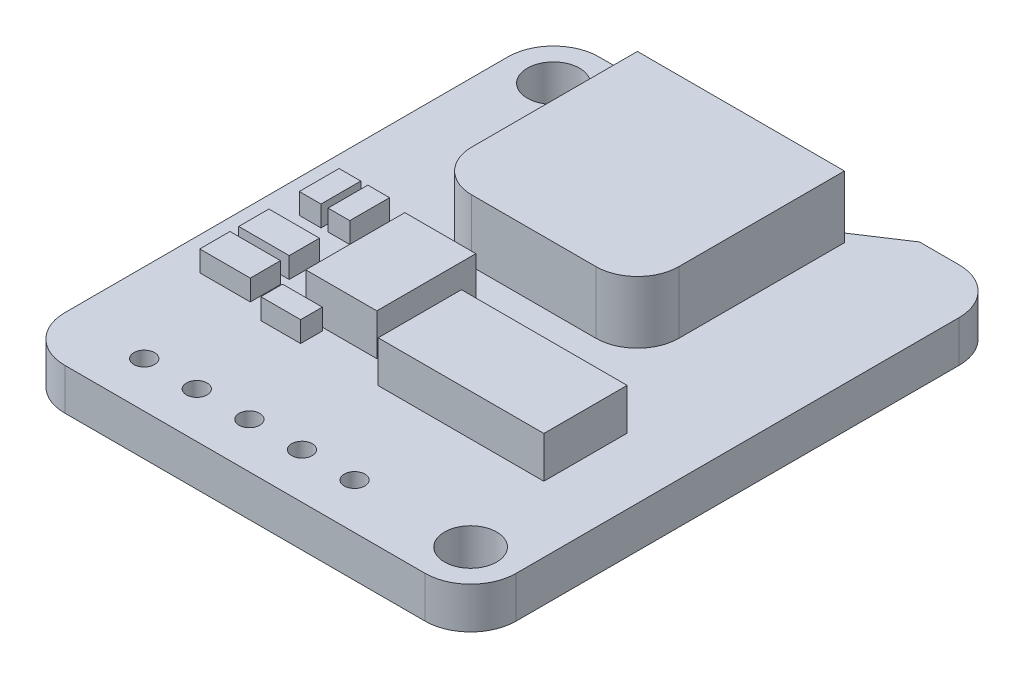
ISO-10303-21;
HEADER;
FILE_DESCRIPTION(('STEP AP214'),'2;1');
FILE_NAME('part.step','',(''),(''),'','','');
FILE_SCHEMA(('AUTOMOTIVE_DESIGN { 1 0 10303 214 1 1 1 1 }'));
ENDSEC;
DATA;
#1=APPLICATION_CONTEXT('core data for automotive mechanical design processes');
#2=APPLICATION_PROTOCOL_DEFINITION('international standard','automotive_design',2000,#1);
#3=PRODUCT_CONTEXT('',#1,'mechanical');
#4=PRODUCT('Part','Part','',(#3));
#5=PRODUCT_RELATED_PRODUCT_CATEGORY('part','',(#4));
#6=PRODUCT_DEFINITION_FORMATION('','',#4);
#7=PRODUCT_DEFINITION_CONTEXT('part definition',#1,'design');
#8=PRODUCT_DEFINITION('design','',#6,#7);
#9=PRODUCT_DEFINITION_SHAPE('','',#8);
#10=(LENGTH_UNIT() NAMED_UNIT(*) SI_UNIT(.MILLI.,.METRE.));
#11=(NAMED_UNIT(*) PLANE_ANGLE_UNIT() SI_UNIT($,.RADIAN.));
#12=(NAMED_UNIT(*) SI_UNIT($,.STERADIAN.) SOLID_ANGLE_UNIT());
#13=UNCERTAINTY_MEASURE_WITH_UNIT(LENGTH_MEASURE(1.E-05),#10,'distance_accuracy_value','');
#14=(GEOMETRIC_REPRESENTATION_CONTEXT(3) GLOBAL_UNCERTAINTY_ASSIGNED_CONTEXT((#13)) GLOBAL_UNIT_ASSIGNED_CONTEXT((#10,
#11,#12)) REPRESENTATION_CONTEXT('',''));
#15=CARTESIAN_POINT('',(0.,0.,0.));
#16=DIRECTION('',(0.,0.,1.));
#17=DIRECTION('',(1.,0.,0.));
#18=AXIS2_PLACEMENT_3D('',#15,#16,#17);
#19=CARTESIAN_POINT('',(2.2,2.,-23.6));
#20=DIRECTION('',(0.,-1.,0.));
#21=DIRECTION('',(0.,0.,-1.));
#22=AXIS2_PLACEMENT_3D('',#19,#20,#21);
#23=PLANE('',#22);
#24=DIRECTION('',(0.,0.,1.));
#25=VECTOR('',#24,1.);
#26=CARTESIAN_POINT('',(1.5932561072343,2.,-7.12866431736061));
#27=LINE('',#26,#25);
#28=CARTESIAN_POINT('',(1.5932561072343,2.,-8.58773781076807));
#29=VERTEX_POINT('',#28);
#30=CARTESIAN_POINT('',(1.5932561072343,2.,-7.12866431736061));
#31=VERTEX_POINT('',#30);
#32=EDGE_CURVE('E369',#29,#31,#27,.T.);
#33=ORIENTED_EDGE('',*,*,#32,.F.);
#34=DIRECTION('',(-1.,0.,0.));
#35=VECTOR('',#34,1.);
#36=CARTESIAN_POINT('',(1.5932561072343,2.,-8.58773781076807));
#37=LINE('',#36,#35);
#38=CARTESIAN_POINT('',(4.03141565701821,2.,-8.58773781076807));
#39=VERTEX_POINT('',#38);
#40=EDGE_CURVE('E382',#39,#29,#37,.T.);
#41=ORIENTED_EDGE('',*,*,#40,.F.);
#42=DIRECTION('',(0.,0.,-1.));
#43=VECTOR('',#42,1.);
#44=CARTESIAN_POINT('',(4.03141565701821,2.,-7.12866431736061));
#45=LINE('',#44,#43);
#46=CARTESIAN_POINT('',(4.03141565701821,2.,-7.12866431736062));
#47=VERTEX_POINT('',#46);
#48=EDGE_CURVE('E391',#47,#39,#45,.T.);
#49=ORIENTED_EDGE('',*,*,#48,.F.);
#50=DIRECTION('',(1.,0.,0.));
#51=VECTOR('',#50,1.);
#52=CARTESIAN_POINT('',(1.5932561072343,2.,-7.12866431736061));
#53=LINE('',#52,#51);
#54=EDGE_CURVE('E372',#31,#47,#53,.T.);
#55=ORIENTED_EDGE('',*,*,#54,.F.);
#56=EDGE_LOOP('',(#33,#41,#49,#55));
#57=FACE_BOUND('',#56,.T.);
#58=DIRECTION('',(0.,0.,1.));
#59=VECTOR('',#58,1.);
#60=CARTESIAN_POINT('',(2.9825949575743,2.,-11.933852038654));
#61=LINE('',#60,#59);
#62=CARTESIAN_POINT('',(2.9825949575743,2.,-13.8548337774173));
#63=VERTEX_POINT('',#62);
#64=CARTESIAN_POINT('',(2.9825949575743,2.,-11.933852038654));
#65=VERTEX_POINT('',#64);
#66=EDGE_CURVE('E440',#63,#65,#61,.T.);
#67=ORIENTED_EDGE('',*,*,#66,.F.);
#68=DIRECTION('',(-1.,0.,0.));
#69=VECTOR('',#68,1.);
#70=CARTESIAN_POINT('',(2.9825949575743,2.,-13.8548337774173));
#71=LINE('',#70,#69);
#72=CARTESIAN_POINT('',(4.03141565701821,2.,-13.8548337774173));
#73=VERTEX_POINT('',#72);
#74=EDGE_CURVE('E445',#73,#63,#71,.T.);
#75=ORIENTED_EDGE('',*,*,#74,.F.);
#76=DIRECTION('',(0.,0.,-1.));
#77=VECTOR('',#76,1.);
#78=CARTESIAN_POINT('',(4.03141565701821,2.,-11.933852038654));
#79=LINE('',#78,#77);
#80=CARTESIAN_POINT('',(4.03141565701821,2.,-11.933852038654));
#81=VERTEX_POINT('',#80);
#82=EDGE_CURVE('E457',#81,#73,#79,.T.);
#83=ORIENTED_EDGE('',*,*,#82,.F.);
#84=DIRECTION('',(1.,0.,0.));
#85=VECTOR('',#84,1.);
#86=CARTESIAN_POINT('',(2.9825949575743,2.,-11.933852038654));
#87=LINE('',#86,#85);
#88=EDGE_CURVE('E454',#65,#81,#87,.T.);
#89=ORIENTED_EDGE('',*,*,#88,.F.);
#90=EDGE_LOOP('',(#67,#75,#83,#89));
#91=FACE_BOUND('',#90,.T.);
#92=DIRECTION('',(0.,0.,1.));
#93=VECTOR('',#92,1.);
#94=CARTESIAN_POINT('',(10.6174370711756,2.,-6.71868920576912));
#95=LINE('',#94,#93);
#96=CARTESIAN_POINT('',(10.6174370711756,2.,-10.7409367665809));
#97=VERTEX_POINT('',#96);
#98=CARTESIAN_POINT('',(10.6174370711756,2.,-6.71868920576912));
#99=VERTEX_POINT('',#98);
#100=EDGE_CURVE('E506',#97,#99,#95,.T.);
#101=ORIENTED_EDGE('',*,*,#100,.F.);
#102=DIRECTION('',(-1.,0.,0.));
#103=VECTOR('',#102,1.);
#104=CARTESIAN_POINT('',(10.6174370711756,2.,-10.7409367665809));
#105=LINE('',#104,#103);
#106=CARTESIAN_POINT('',(18.6194738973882,2.,-10.7409367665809));
#107=VERTEX_POINT('',#106);
#108=EDGE_CURVE('E511',#107,#97,#105,.T.);
#109=ORIENTED_EDGE('',*,*,#108,.F.);
#110=DIRECTION('',(0.,0.,-1.));
#111=VECTOR('',#110,1.);
#112=CARTESIAN_POINT('',(18.6194738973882,2.,-6.71868920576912));
#113=LINE('',#112,#111);
#114=CARTESIAN_POINT('',(18.6194738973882,2.,-6.71868920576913));
#115=VERTEX_POINT('',#114);
#116=EDGE_CURVE('E523',#115,#107,#113,.T.);
#117=ORIENTED_EDGE('',*,*,#116,.F.);
#118=DIRECTION('',(1.,0.,0.));
#119=VECTOR('',#118,1.);
#120=CARTESIAN_POINT('',(10.6174370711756,2.,-6.71868920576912));
#121=LINE('',#120,#119);
#122=EDGE_CURVE('E520',#99,#115,#121,.T.);
#123=ORIENTED_EDGE('',*,*,#122,.F.);
#124=EDGE_LOOP('',(#101,#109,#117,#123));
#125=FACE_BOUND('',#124,.T.);
#126=DIRECTION('',(-1.,0.,0.));
#127=VECTOR('',#126,1.);
#128=CARTESIAN_POINT('',(5.9,2.,-23.9558858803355));
#129=LINE('',#128,#127);
#130=CARTESIAN_POINT('',(15.9,2.,-23.9558858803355));
#131=VERTEX_POINT('',#130);
#132=CARTESIAN_POINT('',(14.8784512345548,2.,-23.9558858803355));
#133=VERTEX_POINT('',#132);
#134=EDGE_CURVE('E44',#131,#133,#129,.T.);
#135=ORIENTED_EDGE('',*,*,#134,.F.);
#136=DIRECTION('',(0.,0.,-1.));
#137=VECTOR('',#136,1.);
#138=CARTESIAN_POINT('',(15.9,2.,-15.9558858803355));
#139=LINE('',#138,#137);
#140=CARTESIAN_POINT('',(15.9,2.,-15.9558858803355));
#141=VERTEX_POINT('',#140);
#142=EDGE_CURVE('E572',#141,#131,#139,.T.);
#143=ORIENTED_EDGE('',*,*,#142,.F.);
#144=CARTESIAN_POINT('',(13.9,2.,-15.9558858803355));
#145=DIRECTION('',(0.,1.,0.));
#146=DIRECTION('',(0.,0.,1.));
#147=AXIS2_PLACEMENT_3D('',#144,#145,#146);
#148=CIRCLE('',#147,2.);
#149=CARTESIAN_POINT('',(13.9,2.,-13.9558858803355));
#150=VERTEX_POINT('',#149);
#151=EDGE_CURVE('E577',#150,#141,#148,.T.);
#152=ORIENTED_EDGE('',*,*,#151,.F.);
#153=DIRECTION('',(1.,0.,0.));
#154=VECTOR('',#153,1.);
#155=CARTESIAN_POINT('',(7.9,2.,-13.9558858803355));
#156=LINE('',#155,#154);
#157=CARTESIAN_POINT('',(7.9,2.,-13.9558858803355));
#158=VERTEX_POINT('',#157);
#159=EDGE_CURVE('E597',#158,#150,#156,.T.);
#160=ORIENTED_EDGE('',*,*,#159,.F.);
#161=CARTESIAN_POINT('',(7.9,2.,-15.9558858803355));
#162=DIRECTION('',(0.,1.,0.));
#163=DIRECTION('',(0.,0.,-1.));
#164=AXIS2_PLACEMENT_3D('',#161,#162,#163);
#165=CIRCLE('',#164,2.);
#166=CARTESIAN_POINT('',(5.9,2.,-15.9558858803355));
#167=VERTEX_POINT('',#166);
#168=EDGE_CURVE('E594',#167,#158,#165,.T.);
#169=ORIENTED_EDGE('',*,*,#168,.F.);
#170=DIRECTION('',(0.,0.,1.));
#171=VECTOR('',#170,1.);
#172=CARTESIAN_POINT('',(5.9,2.,-15.9558858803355));
#173=LINE('',#172,#171);
#174=CARTESIAN_POINT('',(5.9,2.,-23.9558858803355));
#175=VERTEX_POINT('',#174);
#176=EDGE_CURVE('E591',#175,#167,#173,.T.);
#177=ORIENTED_EDGE('',*,*,#176,.F.);
#178=CARTESIAN_POINT('',(6.32740747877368,2.,-23.9558858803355));
#179=VERTEX_POINT('',#178);
#180=EDGE_CURVE('E11',#179,#175,#129,.T.);
#181=ORIENTED_EDGE('',*,*,#180,.F.);
#182=CARTESIAN_POINT('',(7.6824443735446,2.,-25.4268974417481));
#183=DIRECTION('',(0.,-1.,0.));
#184=DIRECTION('',(0.,0.,1.));
#185=AXIS2_PLACEMENT_3D('',#182,#183,#184);
#186=CIRCLE('',#185,2.);
#187=CARTESIAN_POINT('',(6.26823081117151,2.,-24.012683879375));
#188=VERTEX_POINT('',#187);
#189=EDGE_CURVE('E690',#179,#188,#186,.T.);
#190=ORIENTED_EDGE('',*,*,#189,.T.);
#191=DIRECTION('',(-0.707106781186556,0.,-0.707106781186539));
#192=VECTOR('',#191,1.);
#193=CARTESIAN_POINT('',(4.48091469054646,2.,-25.8));
#194=LINE('',#193,#192);
#195=CARTESIAN_POINT('',(4.48091469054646,2.,-25.8));
#196=VERTEX_POINT('',#195);
#197=EDGE_CURVE('E694',#188,#196,#194,.T.);
#198=ORIENTED_EDGE('',*,*,#197,.T.);
#199=DIRECTION('',(-1.,0.,0.));
#200=VECTOR('',#199,1.);
#201=CARTESIAN_POINT('',(2.2,2.,-25.8));
#202=LINE('',#201,#200);
#203=CARTESIAN_POINT('',(2.2,2.,-25.8));
#204=VERTEX_POINT('',#203);
#205=EDGE_CURVE('E696',#196,#204,#202,.T.);
#206=ORIENTED_EDGE('',*,*,#205,.T.);
#207=CARTESIAN_POINT('',(2.2,2.,-23.6));
#208=DIRECTION('',(0.,1.,0.));
#209=DIRECTION('',(0.,0.,-1.));
#210=AXIS2_PLACEMENT_3D('',#207,#208,#209);
#211=CIRCLE('',#210,2.2);
#212=CARTESIAN_POINT('',(0.,2.,-23.6));
#213=VERTEX_POINT('',#212);
#214=EDGE_CURVE('E662',#204,#213,#211,.T.);
#215=ORIENTED_EDGE('',*,*,#214,.T.);
#216=DIRECTION('',(0.,0.,1.));
#217=VECTOR('',#216,1.);
#218=CARTESIAN_POINT('',(0.,2.,-2.2));
#219=LINE('',#218,#217);
#220=CARTESIAN_POINT('',(0.,2.,-2.2));
#221=VERTEX_POINT('',#220);
#222=EDGE_CURVE('E665',#213,#221,#219,.T.);
#223=ORIENTED_EDGE('',*,*,#222,.T.);
#224=CARTESIAN_POINT('',(2.2,2.,-2.2));
#225=DIRECTION('',(0.,1.,0.));
#226=DIRECTION('',(0.,0.,-1.));
#227=AXIS2_PLACEMENT_3D('',#224,#225,#226);
#228=CIRCLE('',#227,2.2);
#229=CARTESIAN_POINT('',(2.2,2.,0.));
#230=VERTEX_POINT('',#229);
#231=EDGE_CURVE('E668',#221,#230,#228,.T.);
#232=ORIENTED_EDGE('',*,*,#231,.T.);
#233=DIRECTION('',(1.,0.,0.));
#234=VECTOR('',#233,1.);
#235=CARTESIAN_POINT('',(2.2,2.,0.));
#236=LINE('',#235,#234);
#237=CARTESIAN_POINT('',(19.6,2.,0.));
#238=VERTEX_POINT('',#237);
#239=EDGE_CURVE('E670',#230,#238,#236,.T.);
#240=ORIENTED_EDGE('',*,*,#239,.T.);
#241=CARTESIAN_POINT('',(19.6,2.,-2.2));
#242=DIRECTION('',(0.,1.,0.));
#243=DIRECTION('',(0.,0.,1.));
#244=AXIS2_PLACEMENT_3D('',#241,#242,#243);
#245=CIRCLE('',#244,2.2);
#246=CARTESIAN_POINT('',(21.8,2.,-2.2));
#247=VERTEX_POINT('',#246);
#248=EDGE_CURVE('E672',#238,#247,#245,.T.);
#249=ORIENTED_EDGE('',*,*,#248,.T.);
#250=DIRECTION('',(0.,0.,-1.));
#251=VECTOR('',#250,1.);
#252=CARTESIAN_POINT('',(21.8,2.,-2.2));
#253=LINE('',#252,#251);
#254=CARTESIAN_POINT('',(21.8,2.,-23.6));
#255=VERTEX_POINT('',#254);
#256=EDGE_CURVE('E674',#247,#255,#253,.T.);
#257=ORIENTED_EDGE('',*,*,#256,.T.);
#258=CARTESIAN_POINT('',(19.6,2.,-23.6));
#259=DIRECTION('',(0.,1.,0.));
#260=DIRECTION('',(0.,0.,-1.));
#261=AXIS2_PLACEMENT_3D('',#258,#259,#260);
#262=CIRCLE('',#261,2.2);
#263=CARTESIAN_POINT('',(19.6,2.,-25.8));
#264=VERTEX_POINT('',#263);
#265=EDGE_CURVE('E676',#255,#264,#262,.T.);
#266=ORIENTED_EDGE('',*,*,#265,.T.);
#267=DIRECTION('',(-1.,0.,0.));
#268=VECTOR('',#267,1.);
#269=CARTESIAN_POINT('',(17.6826935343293,2.,-25.8));
#270=LINE('',#269,#268);
#271=CARTESIAN_POINT('',(17.6826935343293,2.,-25.8));
#272=VERTEX_POINT('',#271);
#273=EDGE_CURVE('E678',#264,#272,#270,.T.);
#274=ORIENTED_EDGE('',*,*,#273,.T.);
#275=DIRECTION('',(-0.835524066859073,0.,0.5494538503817));
#276=VECTOR('',#275,1.);
#277=CARTESIAN_POINT('',(14.5742666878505,2.,-23.7558493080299));
#278=LINE('',#277,#276);
#279=EDGE_CURVE('E681',#272,#133,#278,.T.);
#280=ORIENTED_EDGE('',*,*,#279,.T.);
#281=EDGE_LOOP('',(#135,#143,#152,#160,#169,#177,#181,#190,#198,#206,#215,#223,#232,#240,#249,
#257,#266,#274,#280));
#282=FACE_BOUND('',#281,.T.);
#283=CARTESIAN_POINT('',(2.2,2.,-23.6));
#284=DIRECTION('',(0.,1.,0.));
#285=DIRECTION('',(0.,0.,1.));
#286=AXIS2_PLACEMENT_3D('',#283,#284,#285);
#287=CIRCLE('',#286,1.25963535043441);
#288=CARTESIAN_POINT('',(2.2,2.,-22.3403646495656));
#289=VERTEX_POINT('',#288);
#290=EDGE_CURVE('E656',#289,#289,#287,.T.);
#291=ORIENTED_EDGE('',*,*,#290,.F.);
#292=EDGE_LOOP('',(#291));
#293=FACE_BOUND('',#292,.T.);
#294=CARTESIAN_POINT('',(19.6,2.,-2.2));
#295=DIRECTION('',(0.,1.,0.));
#296=DIRECTION('',(0.,0.,1.));
#297=AXIS2_PLACEMENT_3D('',#294,#295,#296);
#298=CIRCLE('',#297,1.25963535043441);
#299=CARTESIAN_POINT('',(19.6,2.,-0.940364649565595));
#300=VERTEX_POINT('',#299);
#301=EDGE_CURVE('E650',#300,#300,#298,.T.);
#302=ORIENTED_EDGE('',*,*,#301,.F.);
#303=EDGE_LOOP('',(#302));
#304=FACE_BOUND('',#303,.T.);
#305=CARTESIAN_POINT('',(3.83686877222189,2.,-2.2));
#306=DIRECTION('',(0.,1.,0.));
#307=DIRECTION('',(0.,0.,1.));
#308=AXIS2_PLACEMENT_3D('',#305,#306,#307);
#309=CIRCLE('',#308,0.500000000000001);
#310=CARTESIAN_POINT('',(3.83686877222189,2.,-1.7));
#311=VERTEX_POINT('',#310);
#312=EDGE_CURVE('E644',#311,#311,#309,.T.);
#313=ORIENTED_EDGE('',*,*,#312,.F.);
#314=EDGE_LOOP('',(#313));
#315=FACE_BOUND('',#314,.T.);
#316=CARTESIAN_POINT('',(6.37686877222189,2.,-2.2));
#317=DIRECTION('',(0.,1.,0.));
#318=DIRECTION('',(0.,0.,1.));
#319=AXIS2_PLACEMENT_3D('',#316,#317,#318);
#320=CIRCLE('',#319,0.500000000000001);
#321=CARTESIAN_POINT('',(6.37686877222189,2.,-1.7));
#322=VERTEX_POINT('',#321);
#323=EDGE_CURVE('E638',#322,#322,#320,.T.);
#324=ORIENTED_EDGE('',*,*,#323,.F.);
#325=EDGE_LOOP('',(#324));
#326=FACE_BOUND('',#325,.T.);
#327=CARTESIAN_POINT('',(8.91686877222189,2.,-2.2));
#328=DIRECTION('',(0.,1.,0.));
#329=DIRECTION('',(0.,0.,1.));
#330=AXIS2_PLACEMENT_3D('',#327,#328,#329);
#331=CIRCLE('',#330,0.499999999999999);
#332=CARTESIAN_POINT('',(8.91686877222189,2.,-1.7));
#333=VERTEX_POINT('',#332);
#334=EDGE_CURVE('E632',#333,#333,#331,.T.);
#335=ORIENTED_EDGE('',*,*,#334,.F.);
#336=EDGE_LOOP('',(#335));
#337=FACE_BOUND('',#336,.T.);
#338=CARTESIAN_POINT('',(11.4568687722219,2.,-2.2));
#339=DIRECTION('',(0.,1.,0.));
#340=DIRECTION('',(0.,0.,1.));
#341=AXIS2_PLACEMENT_3D('',#338,#339,#340);
#342=CIRCLE('',#341,0.500000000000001);
#343=CARTESIAN_POINT('',(11.4568687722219,2.,-1.7));
#344=VERTEX_POINT('',#343);
#345=EDGE_CURVE('E626',#344,#344,#342,.T.);
#346=ORIENTED_EDGE('',*,*,#345,.F.);
#347=EDGE_LOOP('',(#346));
#348=FACE_BOUND('',#347,.T.);
#349=CARTESIAN_POINT('',(13.9968687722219,2.,-2.2));
#350=DIRECTION('',(0.,1.,0.));
#351=DIRECTION('',(0.,0.,1.));
#352=AXIS2_PLACEMENT_3D('',#349,#350,#351);
#353=CIRCLE('',#352,0.500000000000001);
#354=CARTESIAN_POINT('',(13.9968687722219,2.,-1.7));
#355=VERTEX_POINT('',#354);
#356=EDGE_CURVE('E620',#355,#355,#353,.T.);
#357=ORIENTED_EDGE('',*,*,#356,.F.);
#358=EDGE_LOOP('',(#357));
#359=FACE_BOUND('',#358,.T.);
#360=DIRECTION('',(0.,0.,1.));
#361=VECTOR('',#360,1.);
#362=CARTESIAN_POINT('',(6.02619536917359,2.,-12.5979282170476));
#363=LINE('',#362,#361);
#364=CARTESIAN_POINT('',(6.02619536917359,2.,-12.5979282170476));
#365=VERTEX_POINT('',#364);
#366=CARTESIAN_POINT('',(6.02619536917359,2.,-7.81295109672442));
#367=VERTEX_POINT('',#366);
#368=EDGE_CURVE('E539',#365,#367,#363,.T.);
#369=ORIENTED_EDGE('',*,*,#368,.F.);
#370=DIRECTION('',(-1.,0.,0.));
#371=VECTOR('',#370,1.);
#372=CARTESIAN_POINT('',(6.02619536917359,2.,-12.5979282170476));
#373=LINE('',#372,#371);
#374=CARTESIAN_POINT('',(9.45659771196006,2.,-12.5979282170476));
#375=VERTEX_POINT('',#374);
#376=EDGE_CURVE('E544',#375,#365,#373,.T.);
#377=ORIENTED_EDGE('',*,*,#376,.F.);
#378=DIRECTION('',(0.,0.,-1.));
#379=VECTOR('',#378,1.);
#380=CARTESIAN_POINT('',(9.45659771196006,2.,-12.5979282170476));
#381=LINE('',#380,#379);
#382=CARTESIAN_POINT('',(9.45659771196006,2.,-7.81295109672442));
#383=VERTEX_POINT('',#382);
#384=EDGE_CURVE('E556',#383,#375,#381,.T.);
#385=ORIENTED_EDGE('',*,*,#384,.F.);
#386=DIRECTION('',(1.,0.,0.));
#387=VECTOR('',#386,1.);
#388=CARTESIAN_POINT('',(6.02619536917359,2.,-7.81295109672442));
#389=LINE('',#388,#387);
#390=EDGE_CURVE('E553',#367,#383,#389,.T.);
#391=ORIENTED_EDGE('',*,*,#390,.F.);
#392=EDGE_LOOP('',(#369,#377,#385,#391));
#393=FACE_BOUND('',#392,.T.);
#394=DIRECTION('',(0.,0.,1.));
#395=VECTOR('',#394,1.);
#396=CARTESIAN_POINT('',(1.5932561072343,2.,-11.933852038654));
#397=LINE('',#396,#395);
#398=CARTESIAN_POINT('',(1.5932561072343,2.,-13.8548337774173));
#399=VERTEX_POINT('',#398);
#400=CARTESIAN_POINT('',(1.5932561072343,2.,-11.933852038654));
#401=VERTEX_POINT('',#400);
#402=EDGE_CURVE('E473',#399,#401,#397,.T.);
#403=ORIENTED_EDGE('',*,*,#402,.F.);
#404=DIRECTION('',(-1.,0.,0.));
#405=VECTOR('',#404,1.);
#406=CARTESIAN_POINT('',(1.5932561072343,2.,-13.8548337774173));
#407=LINE('',#406,#405);
#408=CARTESIAN_POINT('',(2.64207680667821,2.,-13.8548337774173));
#409=VERTEX_POINT('',#408);
#410=EDGE_CURVE('E478',#409,#399,#407,.T.);
#411=ORIENTED_EDGE('',*,*,#410,.F.);
#412=DIRECTION('',(0.,0.,-1.));
#413=VECTOR('',#412,1.);
#414=CARTESIAN_POINT('',(2.64207680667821,2.,-11.933852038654));
#415=LINE('',#414,#413);
#416=CARTESIAN_POINT('',(2.64207680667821,2.,-11.933852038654));
#417=VERTEX_POINT('',#416);
#418=EDGE_CURVE('E490',#417,#409,#415,.T.);
#419=ORIENTED_EDGE('',*,*,#418,.F.);
#420=DIRECTION('',(1.,0.,0.));
#421=VECTOR('',#420,1.);
#422=CARTESIAN_POINT('',(1.5932561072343,2.,-11.933852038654));
#423=LINE('',#422,#421);
#424=EDGE_CURVE('E487',#401,#417,#423,.T.);
#425=ORIENTED_EDGE('',*,*,#424,.F.);
#426=EDGE_LOOP('',(#403,#411,#419,#425));
#427=FACE_BOUND('',#426,.T.);
#428=DIRECTION('',(0.,0.,-1.));
#429=VECTOR('',#428,1.);
#430=CARTESIAN_POINT('',(6.98668623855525,2.,-7.65307466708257));
#431=LINE('',#430,#429);
#432=CARTESIAN_POINT('',(6.98668623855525,2.,-6.60425396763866));
#433=VERTEX_POINT('',#432);
#434=CARTESIAN_POINT('',(6.98668623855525,2.,-7.65307466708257));
#435=VERTEX_POINT('',#434);
#436=EDGE_CURVE('E407',#433,#435,#431,.T.);
#437=ORIENTED_EDGE('',*,*,#436,.F.);
#438=DIRECTION('',(1.,0.,0.));
#439=VECTOR('',#438,1.);
#440=CARTESIAN_POINT('',(6.98668623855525,2.,-6.60425396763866));
#441=LINE('',#440,#439);
#442=CARTESIAN_POINT('',(5.06570449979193,2.,-6.60425396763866));
#443=VERTEX_POINT('',#442);
#444=EDGE_CURVE('E412',#443,#433,#441,.T.);
#445=ORIENTED_EDGE('',*,*,#444,.F.);
#446=DIRECTION('',(0.,0.,1.));
#447=VECTOR('',#446,1.);
#448=CARTESIAN_POINT('',(5.06570449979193,2.,-7.65307466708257));
#449=LINE('',#448,#447);
#450=CARTESIAN_POINT('',(5.06570449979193,2.,-7.65307466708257));
#451=VERTEX_POINT('',#450);
#452=EDGE_CURVE('E424',#451,#443,#449,.T.);
#453=ORIENTED_EDGE('',*,*,#452,.F.);
#454=DIRECTION('',(-1.,0.,0.));
#455=VECTOR('',#454,1.);
#456=CARTESIAN_POINT('',(6.98668623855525,2.,-7.65307466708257));
#457=LINE('',#456,#455);
#458=EDGE_CURVE('E421',#435,#451,#457,.T.);
#459=ORIENTED_EDGE('',*,*,#458,.F.);
#460=EDGE_LOOP('',(#437,#445,#453,#459));
#461=FACE_BOUND('',#460,.T.);
#462=DIRECTION('',(0.,0.,1.));
#463=VECTOR('',#462,1.);
#464=CARTESIAN_POINT('',(1.5932561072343,2.,-9.00863366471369));
#465=LINE('',#464,#463);
#466=CARTESIAN_POINT('',(1.5932561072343,2.,-10.4677071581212));
#467=VERTEX_POINT('',#466);
#468=CARTESIAN_POINT('',(1.5932561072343,2.,-9.00863366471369));
#469=VERTEX_POINT('',#468);
#470=EDGE_CURVE('E368',#467,#469,#465,.T.);
#471=ORIENTED_EDGE('',*,*,#470,.F.);
#472=DIRECTION('',(-1.,0.,0.));
#473=VECTOR('',#472,1.);
#474=CARTESIAN_POINT('',(1.5932561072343,2.,-10.4677071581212));
#475=LINE('',#474,#473);
#476=CARTESIAN_POINT('',(4.03141565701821,2.,-10.4677071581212));
#477=VERTEX_POINT('',#476);
#478=EDGE_CURVE('E365',#477,#467,#475,.T.);
#479=ORIENTED_EDGE('',*,*,#478,.F.);
#480=DIRECTION('',(0.,0.,-1.));
#481=VECTOR('',#480,1.);
#482=CARTESIAN_POINT('',(4.03141565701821,2.,-9.00863366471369));
#483=LINE('',#482,#481);
#484=CARTESIAN_POINT('',(4.03141565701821,2.,-9.00863366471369));
#485=VERTEX_POINT('',#484);
#486=EDGE_CURVE('E57',#485,#477,#483,.T.);
#487=ORIENTED_EDGE('',*,*,#486,.F.);
#488=DIRECTION('',(1.,0.,0.));
#489=VECTOR('',#488,1.);
#490=CARTESIAN_POINT('',(1.5932561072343,2.,-9.00863366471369));
#491=LINE('',#490,#489);
#492=EDGE_CURVE('E52',#469,#485,#491,.T.);
#493=ORIENTED_EDGE('',*,*,#492,.F.);
#494=EDGE_LOOP('',(#471,#479,#487,#493));
#495=FACE_BOUND('',#494,.T.);
#496=ADVANCED_FACE('F34',(#57,#91,#125,#282,#293,#304,#315,#326,#337,#348,#359,#393,#427,#461,
#495),#23,.F.);
#497=CARTESIAN_POINT('',(2.2,0.,-23.6));
#498=DIRECTION('',(0.,-1.,0.));
#499=DIRECTION('',(0.,0.,-1.));
#500=AXIS2_PLACEMENT_3D('',#497,#498,#499);
#501=PLANE('',#500);
#502=CARTESIAN_POINT('',(11.4568687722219,0.,-2.2));
#503=DIRECTION('',(0.,1.,0.));
#504=DIRECTION('',(0.,0.,1.));
#505=AXIS2_PLACEMENT_3D('',#502,#503,#504);
#506=CIRCLE('',#505,0.500000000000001);
#507=CARTESIAN_POINT('',(11.4568687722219,0.,-1.7));
#508=VERTEX_POINT('',#507);
#509=EDGE_CURVE('E623',#508,#508,#506,.T.);
#510=ORIENTED_EDGE('',*,*,#509,.T.);
#511=EDGE_LOOP('',(#510));
#512=FACE_BOUND('',#511,.T.);
#513=CARTESIAN_POINT('',(6.37686877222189,0.,-2.2));
#514=DIRECTION('',(0.,1.,0.));
#515=DIRECTION('',(0.,0.,1.));
#516=AXIS2_PLACEMENT_3D('',#513,#514,#515);
#517=CIRCLE('',#516,0.500000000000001);
#518=CARTESIAN_POINT('',(6.37686877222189,0.,-1.7));
#519=VERTEX_POINT('',#518);
#520=EDGE_CURVE('E635',#519,#519,#517,.T.);
#521=ORIENTED_EDGE('',*,*,#520,.T.);
#522=EDGE_LOOP('',(#521));
#523=FACE_BOUND('',#522,.T.);
#524=CARTESIAN_POINT('',(19.6,0.,-2.2));
#525=DIRECTION('',(0.,1.,0.));
#526=DIRECTION('',(0.,0.,1.));
#527=AXIS2_PLACEMENT_3D('',#524,#525,#526);
#528=CIRCLE('',#527,1.25963535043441);
#529=CARTESIAN_POINT('',(19.6,0.,-0.940364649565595));
#530=VERTEX_POINT('',#529);
#531=EDGE_CURVE('E647',#530,#530,#528,.T.);
#532=ORIENTED_EDGE('',*,*,#531,.T.);
#533=EDGE_LOOP('',(#532));
#534=FACE_BOUND('',#533,.T.);
#535=CARTESIAN_POINT('',(2.2,0.,-23.6));
#536=DIRECTION('',(0.,1.,0.));
#537=DIRECTION('',(0.,0.,-1.));
#538=AXIS2_PLACEMENT_3D('',#535,#536,#537);
#539=CIRCLE('',#538,2.2);
#540=CARTESIAN_POINT('',(2.2,0.,-25.8));
#541=VERTEX_POINT('',#540);
#542=CARTESIAN_POINT('',(0.,0.,-23.6));
#543=VERTEX_POINT('',#542);
#544=EDGE_CURVE('E659',#541,#543,#539,.T.);
#545=ORIENTED_EDGE('',*,*,#544,.F.);
#546=DIRECTION('',(-1.,0.,0.));
#547=VECTOR('',#546,1.);
#548=CARTESIAN_POINT('',(2.2,0.,-25.8));
#549=LINE('',#548,#547);
#550=CARTESIAN_POINT('',(4.48091469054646,0.,-25.8));
#551=VERTEX_POINT('',#550);
#552=EDGE_CURVE('E666',#551,#541,#549,.T.);
#553=ORIENTED_EDGE('',*,*,#552,.F.);
#554=DIRECTION('',(-0.707106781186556,0.,-0.707106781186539));
#555=VECTOR('',#554,1.);
#556=CARTESIAN_POINT('',(4.48091469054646,0.,-25.8));
#557=LINE('',#556,#555);
#558=CARTESIAN_POINT('',(6.26823081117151,0.,-24.012683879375));
#559=VERTEX_POINT('',#558);
#560=EDGE_CURVE('E723',#559,#551,#557,.T.);
#561=ORIENTED_EDGE('',*,*,#560,.F.);
#562=CARTESIAN_POINT('',(7.6824443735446,0.,-25.4268974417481));
#563=DIRECTION('',(0.,-1.,0.));
#564=DIRECTION('',(0.,0.,1.));
#565=AXIS2_PLACEMENT_3D('',#562,#563,#564);
#566=CIRCLE('',#565,2.);
#567=CARTESIAN_POINT('',(7.6824443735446,0.,-23.4268974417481));
#568=VERTEX_POINT('',#567);
#569=EDGE_CURVE('E721',#568,#559,#566,.T.);
#570=ORIENTED_EDGE('',*,*,#569,.F.);
#571=DIRECTION('',(-1.,0.,0.));
#572=VECTOR('',#571,1.);
#573=CARTESIAN_POINT('',(7.6824443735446,0.,-23.4268974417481));
#574=LINE('',#573,#572);
#575=CARTESIAN_POINT('',(13.4753589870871,0.,-23.4268974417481));
#576=VERTEX_POINT('',#575);
#577=EDGE_CURVE('E719',#576,#568,#574,.T.);
#578=ORIENTED_EDGE('',*,*,#577,.F.);
#579=CARTESIAN_POINT('',(13.4753589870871,0.,-25.4268974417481));
#580=DIRECTION('',(0.,-1.,0.));
#581=DIRECTION('',(0.,0.,1.));
#582=AXIS2_PLACEMENT_3D('',#579,#580,#581);
#583=CIRCLE('',#582,2.00000000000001);
#584=CARTESIAN_POINT('',(14.5742666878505,0.,-23.7558493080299));
#585=VERTEX_POINT('',#584);
#586=EDGE_CURVE('E717',#585,#576,#583,.T.);
#587=ORIENTED_EDGE('',*,*,#586,.F.);
#588=DIRECTION('',(-0.835524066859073,0.,0.5494538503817));
#589=VECTOR('',#588,1.);
#590=CARTESIAN_POINT('',(14.5742666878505,0.,-23.7558493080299));
#591=LINE('',#590,#589);
#592=CARTESIAN_POINT('',(17.6826935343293,0.,-25.8));
#593=VERTEX_POINT('',#592);
#594=EDGE_CURVE('E715',#593,#585,#591,.T.);
#595=ORIENTED_EDGE('',*,*,#594,.F.);
#596=DIRECTION('',(-1.,0.,0.));
#597=VECTOR('',#596,1.);
#598=CARTESIAN_POINT('',(17.6826935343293,0.,-25.8));
#599=LINE('',#598,#597);
#600=CARTESIAN_POINT('',(19.6,0.,-25.8));
#601=VERTEX_POINT('',#600);
#602=EDGE_CURVE('E713',#601,#593,#599,.T.);
#603=ORIENTED_EDGE('',*,*,#602,.F.);
#604=CARTESIAN_POINT('',(19.6,0.,-23.6));
#605=DIRECTION('',(0.,1.,0.));
#606=DIRECTION('',(0.,0.,-1.));
#607=AXIS2_PLACEMENT_3D('',#604,#605,#606);
#608=CIRCLE('',#607,2.2);
#609=CARTESIAN_POINT('',(21.8,0.,-23.6));
#610=VERTEX_POINT('',#609);
#611=EDGE_CURVE('E711',#610,#601,#608,.T.);
#612=ORIENTED_EDGE('',*,*,#611,.F.);
#613=DIRECTION('',(0.,0.,-1.));
#614=VECTOR('',#613,1.);
#615=CARTESIAN_POINT('',(21.8,0.,-2.2));
#616=LINE('',#615,#614);
#617=CARTESIAN_POINT('',(21.8,0.,-2.2));
#618=VERTEX_POINT('',#617);
#619=EDGE_CURVE('E709',#618,#610,#616,.T.);
#620=ORIENTED_EDGE('',*,*,#619,.F.);
#621=CARTESIAN_POINT('',(19.6,0.,-2.2));
#622=DIRECTION('',(0.,1.,0.));
#623=DIRECTION('',(0.,0.,1.));
#624=AXIS2_PLACEMENT_3D('',#621,#622,#623);
#625=CIRCLE('',#624,2.2);
#626=CARTESIAN_POINT('',(19.6,0.,0.));
#627=VERTEX_POINT('',#626);
#628=EDGE_CURVE('E707',#627,#618,#625,.T.);
#629=ORIENTED_EDGE('',*,*,#628,.F.);
#630=DIRECTION('',(1.,0.,0.));
#631=VECTOR('',#630,1.);
#632=CARTESIAN_POINT('',(2.2,0.,0.));
#633=LINE('',#632,#631);
#634=CARTESIAN_POINT('',(2.2,0.,0.));
#635=VERTEX_POINT('',#634);
#636=EDGE_CURVE('E705',#635,#627,#633,.T.);
#637=ORIENTED_EDGE('',*,*,#636,.F.);
#638=CARTESIAN_POINT('',(2.2,0.,-2.2));
#639=DIRECTION('',(0.,1.,0.));
#640=DIRECTION('',(0.,0.,-1.));
#641=AXIS2_PLACEMENT_3D('',#638,#639,#640);
#642=CIRCLE('',#641,2.2);
#643=CARTESIAN_POINT('',(0.,0.,-2.2));
#644=VERTEX_POINT('',#643);
#645=EDGE_CURVE('E703',#644,#635,#642,.T.);
#646=ORIENTED_EDGE('',*,*,#645,.F.);
#647=DIRECTION('',(0.,0.,1.));
#648=VECTOR('',#647,1.);
#649=CARTESIAN_POINT('',(0.,0.,-2.2));
#650=LINE('',#649,#648);
#651=EDGE_CURVE('E701',#543,#644,#650,.T.);
#652=ORIENTED_EDGE('',*,*,#651,.F.);
#653=EDGE_LOOP('',(#545,#553,#561,#570,#578,#587,#595,#603,#612,#620,#629,#637,#646,#652));
#654=FACE_BOUND('',#653,.T.);
#655=CARTESIAN_POINT('',(2.2,0.,-23.6));
#656=DIRECTION('',(0.,1.,0.));
#657=DIRECTION('',(0.,0.,1.));
#658=AXIS2_PLACEMENT_3D('',#655,#656,#657);
#659=CIRCLE('',#658,1.25963535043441);
#660=CARTESIAN_POINT('',(2.2,0.,-22.3403646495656));
#661=VERTEX_POINT('',#660);
#662=EDGE_CURVE('E653',#661,#661,#659,.T.);
#663=ORIENTED_EDGE('',*,*,#662,.T.);
#664=EDGE_LOOP('',(#663));
#665=FACE_BOUND('',#664,.T.);
#666=CARTESIAN_POINT('',(3.83686877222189,0.,-2.2));
#667=DIRECTION('',(0.,1.,0.));
#668=DIRECTION('',(0.,0.,1.));
#669=AXIS2_PLACEMENT_3D('',#666,#667,#668);
#670=CIRCLE('',#669,0.500000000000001);
#671=CARTESIAN_POINT('',(3.83686877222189,0.,-1.7));
#672=VERTEX_POINT('',#671);
#673=EDGE_CURVE('E641',#672,#672,#670,.T.);
#674=ORIENTED_EDGE('',*,*,#673,.T.);
#675=EDGE_LOOP('',(#674));
#676=FACE_BOUND('',#675,.T.);
#677=CARTESIAN_POINT('',(8.91686877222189,0.,-2.2));
#678=DIRECTION('',(0.,1.,0.));
#679=DIRECTION('',(0.,0.,1.));
#680=AXIS2_PLACEMENT_3D('',#677,#678,#679);
#681=CIRCLE('',#680,0.499999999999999);
#682=CARTESIAN_POINT('',(8.91686877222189,0.,-1.7));
#683=VERTEX_POINT('',#682);
#684=EDGE_CURVE('E629',#683,#683,#681,.T.);
#685=ORIENTED_EDGE('',*,*,#684,.T.);
#686=EDGE_LOOP('',(#685));
#687=FACE_BOUND('',#686,.T.);
#688=CARTESIAN_POINT('',(13.9968687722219,0.,-2.2));
#689=DIRECTION('',(0.,1.,0.));
#690=DIRECTION('',(0.,0.,1.));
#691=AXIS2_PLACEMENT_3D('',#688,#689,#690);
#692=CIRCLE('',#691,0.500000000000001);
#693=CARTESIAN_POINT('',(13.9968687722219,0.,-1.7));
#694=VERTEX_POINT('',#693);
#695=EDGE_CURVE('E619',#694,#694,#692,.T.);
#696=ORIENTED_EDGE('',*,*,#695,.T.);
#697=EDGE_LOOP('',(#696));
#698=FACE_BOUND('',#697,.T.);
#699=ADVANCED_FACE('F776',(#512,#523,#534,#654,#665,#676,#687,#698),#501,.T.);
#700=CARTESIAN_POINT('',(2.2,2.,-23.6));
#701=DIRECTION('',(0.,-1.,0.));
#702=DIRECTION('',(0.,0.,-1.));
#703=AXIS2_PLACEMENT_3D('',#700,#701,#702);
#704=CYLINDRICAL_SURFACE('',#703,2.2);
#705=ORIENTED_EDGE('',*,*,#544,.T.);
#706=DIRECTION('',(0.,-1.,0.));
#707=VECTOR('',#706,1.);
#708=CARTESIAN_POINT('',(0.,2.,-23.6));
#709=LINE('',#708,#707);
#710=EDGE_CURVE('E38',#213,#543,#709,.T.);
#711=ORIENTED_EDGE('',*,*,#710,.F.);
#712=ORIENTED_EDGE('',*,*,#214,.F.);
#713=DIRECTION('',(0.,-1.,0.));
#714=VECTOR('',#713,1.);
#715=CARTESIAN_POINT('',(2.2,2.,-25.8));
#716=LINE('',#715,#714);
#717=EDGE_CURVE('E698',#204,#541,#716,.T.);
#718=ORIENTED_EDGE('',*,*,#717,.T.);
#719=EDGE_LOOP('',(#705,#711,#712,#718));
#720=FACE_BOUND('',#719,.T.);
#721=ADVANCED_FACE('F36',(#720),#704,.T.);
#722=CARTESIAN_POINT('',(0.,2.,-2.2));
#723=DIRECTION('',(1.,0.,0.));
#724=DIRECTION('',(0.,0.,-1.));
#725=AXIS2_PLACEMENT_3D('',#722,#723,#724);
#726=PLANE('',#725);
#727=ORIENTED_EDGE('',*,*,#651,.T.);
#728=DIRECTION('',(0.,-1.,0.));
#729=VECTOR('',#728,1.);
#730=CARTESIAN_POINT('',(0.,2.,-2.2));
#731=LINE('',#730,#729);
#732=EDGE_CURVE('E760',#221,#644,#731,.T.);
#733=ORIENTED_EDGE('',*,*,#732,.F.);
#734=ORIENTED_EDGE('',*,*,#222,.F.);
#735=ORIENTED_EDGE('',*,*,#710,.T.);
#736=EDGE_LOOP('',(#727,#733,#734,#735));
#737=FACE_BOUND('',#736,.T.);
#738=ADVANCED_FACE('F769',(#737),#726,.F.);
#739=CARTESIAN_POINT('',(2.2,2.,-2.2));
#740=DIRECTION('',(0.,-1.,0.));
#741=DIRECTION('',(0.,0.,-1.));
#742=AXIS2_PLACEMENT_3D('',#739,#740,#741);
#743=CYLINDRICAL_SURFACE('',#742,2.2);
#744=ORIENTED_EDGE('',*,*,#645,.T.);
#745=DIRECTION('',(0.,-1.,0.));
#746=VECTOR('',#745,1.);
#747=CARTESIAN_POINT('',(2.2,2.,0.));
#748=LINE('',#747,#746);
#749=EDGE_CURVE('E758',#230,#635,#748,.T.);
#750=ORIENTED_EDGE('',*,*,#749,.F.);
#751=ORIENTED_EDGE('',*,*,#231,.F.);
#752=ORIENTED_EDGE('',*,*,#732,.T.);
#753=EDGE_LOOP('',(#744,#750,#751,#752));
#754=FACE_BOUND('',#753,.T.);
#755=ADVANCED_FACE('F782',(#754),#743,.T.);
#756=CARTESIAN_POINT('',(2.2,2.,0.));
#757=DIRECTION('',(0.,0.,-1.));
#758=DIRECTION('',(-1.,0.,0.));
#759=AXIS2_PLACEMENT_3D('',#756,#757,#758);
#760=PLANE('',#759);
#761=ORIENTED_EDGE('',*,*,#636,.T.);
#762=DIRECTION('',(0.,-1.,0.));
#763=VECTOR('',#762,1.);
#764=CARTESIAN_POINT('',(19.6,2.,0.));
#765=LINE('',#764,#763);
#766=EDGE_CURVE('E755',#238,#627,#765,.T.);
#767=ORIENTED_EDGE('',*,*,#766,.F.);
#768=ORIENTED_EDGE('',*,*,#239,.F.);
#769=ORIENTED_EDGE('',*,*,#749,.T.);
#770=EDGE_LOOP('',(#761,#767,#768,#769));
#771=FACE_BOUND('',#770,.T.);
#772=ADVANCED_FACE('F785',(#771),#760,.F.);
#773=CARTESIAN_POINT('',(19.6,2.,-2.2));
#774=DIRECTION('',(0.,-1.,0.));
#775=DIRECTION('',(0.,0.,-1.));
#776=AXIS2_PLACEMENT_3D('',#773,#774,#775);
#777=CYLINDRICAL_SURFACE('',#776,2.2);
#778=ORIENTED_EDGE('',*,*,#628,.T.);
#779=DIRECTION('',(0.,-1.,0.));
#780=VECTOR('',#779,1.);
#781=CARTESIAN_POINT('',(21.8,2.,-2.2));
#782=LINE('',#781,#780);
#783=EDGE_CURVE('E752',#247,#618,#782,.T.);
#784=ORIENTED_EDGE('',*,*,#783,.F.);
#785=ORIENTED_EDGE('',*,*,#248,.F.);
#786=ORIENTED_EDGE('',*,*,#766,.T.);
#787=EDGE_LOOP('',(#778,#784,#785,#786));
#788=FACE_BOUND('',#787,.T.);
#789=ADVANCED_FACE('F833',(#788),#777,.T.);
#790=CARTESIAN_POINT('',(21.8,2.,-2.2));
#791=DIRECTION('',(-1.,0.,0.));
#792=DIRECTION('',(0.,0.,1.));
#793=AXIS2_PLACEMENT_3D('',#790,#791,#792);
#794=PLANE('',#793);
#795=ORIENTED_EDGE('',*,*,#619,.T.);
#796=DIRECTION('',(0.,-1.,0.));
#797=VECTOR('',#796,1.);
#798=CARTESIAN_POINT('',(21.8,2.,-23.6));
#799=LINE('',#798,#797);
#800=EDGE_CURVE('E749',#255,#610,#799,.T.);
#801=ORIENTED_EDGE('',*,*,#800,.F.);
#802=ORIENTED_EDGE('',*,*,#256,.F.);
#803=ORIENTED_EDGE('',*,*,#783,.T.);
#804=EDGE_LOOP('',(#795,#801,#802,#803));
#805=FACE_BOUND('',#804,.T.);
#806=ADVANCED_FACE('F830',(#805),#794,.F.);
#807=CARTESIAN_POINT('',(19.6,2.,-23.6));
#808=DIRECTION('',(0.,-1.,0.));
#809=DIRECTION('',(0.,0.,-1.));
#810=AXIS2_PLACEMENT_3D('',#807,#808,#809);
#811=CYLINDRICAL_SURFACE('',#810,2.2);
#812=ORIENTED_EDGE('',*,*,#611,.T.);
#813=DIRECTION('',(0.,-1.,0.));
#814=VECTOR('',#813,1.);
#815=CARTESIAN_POINT('',(19.6,2.,-25.8));
#816=LINE('',#815,#814);
#817=EDGE_CURVE('E746',#264,#601,#816,.T.);
#818=ORIENTED_EDGE('',*,*,#817,.F.);
#819=ORIENTED_EDGE('',*,*,#265,.F.);
#820=ORIENTED_EDGE('',*,*,#800,.T.);
#821=EDGE_LOOP('',(#812,#818,#819,#820));
#822=FACE_BOUND('',#821,.T.);
#823=ADVANCED_FACE('F826',(#822),#811,.T.);
#824=CARTESIAN_POINT('',(17.6826935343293,2.,-25.8));
#825=DIRECTION('',(0.,0.,1.));
#826=DIRECTION('',(1.,0.,0.));
#827=AXIS2_PLACEMENT_3D('',#824,#825,#826);
#828=PLANE('',#827);
#829=ORIENTED_EDGE('',*,*,#602,.T.);
#830=DIRECTION('',(0.,-1.,0.));
#831=VECTOR('',#830,1.);
#832=CARTESIAN_POINT('',(17.6826935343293,2.,-25.8));
#833=LINE('',#832,#831);
#834=EDGE_CURVE('E743',#272,#593,#833,.T.);
#835=ORIENTED_EDGE('',*,*,#834,.F.);
#836=ORIENTED_EDGE('',*,*,#273,.F.);
#837=ORIENTED_EDGE('',*,*,#817,.T.);
#838=EDGE_LOOP('',(#829,#835,#836,#837));
#839=FACE_BOUND('',#838,.T.);
#840=ADVANCED_FACE('F822',(#839),#828,.F.);
#841=CARTESIAN_POINT('',(14.5742666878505,2.,-23.7558493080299));
#842=DIRECTION('',(0.5494538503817,0.,0.835524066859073));
#843=DIRECTION('',(0.835524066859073,0.,-0.5494538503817));
#844=AXIS2_PLACEMENT_3D('',#841,#842,#843);
#845=PLANE('',#844);
#846=ORIENTED_EDGE('',*,*,#594,.T.);
#847=DIRECTION('',(0.,-1.,0.));
#848=VECTOR('',#847,1.);
#849=CARTESIAN_POINT('',(14.5742666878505,2.,-23.7558493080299));
#850=LINE('',#849,#848);
#851=CARTESIAN_POINT('',(14.5742666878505,2.,-23.7558493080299));
#852=VERTEX_POINT('',#851);
#853=EDGE_CURVE('E740',#852,#585,#850,.T.);
#854=ORIENTED_EDGE('',*,*,#853,.F.);
#855=EDGE_CURVE('E680',#133,#852,#278,.T.);
#856=ORIENTED_EDGE('',*,*,#855,.F.);
#857=ORIENTED_EDGE('',*,*,#279,.F.);
#858=ORIENTED_EDGE('',*,*,#834,.T.);
#859=EDGE_LOOP('',(#846,#854,#856,#857,#858));
#860=FACE_BOUND('',#859,.T.);
#861=ADVANCED_FACE('F817',(#860),#845,.F.);
#862=CARTESIAN_POINT('',(13.4753589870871,2.,-25.4268974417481));
#863=DIRECTION('',(0.,-1.,0.));
#864=DIRECTION('',(0.,0.,-1.));
#865=AXIS2_PLACEMENT_3D('',#862,#863,#864);
#866=CYLINDRICAL_SURFACE('',#865,2.00000000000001);
#867=ORIENTED_EDGE('',*,*,#586,.T.);
#868=DIRECTION('',(0.,-1.,0.));
#869=VECTOR('',#868,1.);
#870=CARTESIAN_POINT('',(13.4753589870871,2.,-23.4268974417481));
#871=LINE('',#870,#869);
#872=CARTESIAN_POINT('',(13.4753589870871,2.,-23.4268974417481));
#873=VERTEX_POINT('',#872);
#874=EDGE_CURVE('E737',#873,#576,#871,.T.);
#875=ORIENTED_EDGE('',*,*,#874,.F.);
#876=CARTESIAN_POINT('',(13.4753589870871,2.,-25.4268974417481));
#877=DIRECTION('',(0.,-1.,0.));
#878=DIRECTION('',(0.,0.,1.));
#879=AXIS2_PLACEMENT_3D('',#876,#877,#878);
#880=CIRCLE('',#879,2.00000000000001);
#881=EDGE_CURVE('E684',#852,#873,#880,.T.);
#882=ORIENTED_EDGE('',*,*,#881,.F.);
#883=ORIENTED_EDGE('',*,*,#853,.T.);
#884=EDGE_LOOP('',(#867,#875,#882,#883));
#885=FACE_BOUND('',#884,.T.);
#886=ADVANCED_FACE('F811',(#885),#866,.F.);
#887=CARTESIAN_POINT('',(7.6824443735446,2.,-23.4268974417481));
#888=DIRECTION('',(0.,0.,1.));
#889=DIRECTION('',(1.,0.,0.));
#890=AXIS2_PLACEMENT_3D('',#887,#888,#889);
#891=PLANE('',#890);
#892=ORIENTED_EDGE('',*,*,#577,.T.);
#893=DIRECTION('',(0.,-1.,0.));
#894=VECTOR('',#893,1.);
#895=CARTESIAN_POINT('',(7.6824443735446,2.,-23.4268974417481));
#896=LINE('',#895,#894);
#897=CARTESIAN_POINT('',(7.6824443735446,2.,-23.4268974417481));
#898=VERTEX_POINT('',#897);
#899=EDGE_CURVE('E734',#898,#568,#896,.T.);
#900=ORIENTED_EDGE('',*,*,#899,.F.);
#901=DIRECTION('',(-1.,0.,0.));
#902=VECTOR('',#901,1.);
#903=CARTESIAN_POINT('',(7.6824443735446,2.,-23.4268974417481));
#904=LINE('',#903,#902);
#905=EDGE_CURVE('E687',#873,#898,#904,.T.);
#906=ORIENTED_EDGE('',*,*,#905,.F.);
#907=ORIENTED_EDGE('',*,*,#874,.T.);
#908=EDGE_LOOP('',(#892,#900,#906,#907));
#909=FACE_BOUND('',#908,.T.);
#910=ADVANCED_FACE('F808',(#909),#891,.F.);
#911=CARTESIAN_POINT('',(7.6824443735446,2.,-25.4268974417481));
#912=DIRECTION('',(0.,-1.,0.));
#913=DIRECTION('',(0.,0.,-1.));
#914=AXIS2_PLACEMENT_3D('',#911,#912,#913);
#915=CYLINDRICAL_SURFACE('',#914,2.);
#916=ORIENTED_EDGE('',*,*,#569,.T.);
#917=DIRECTION('',(0.,-1.,0.));
#918=VECTOR('',#917,1.);
#919=CARTESIAN_POINT('',(6.26823081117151,2.,-24.012683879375));
#920=LINE('',#919,#918);
#921=EDGE_CURVE('E731',#188,#559,#920,.T.);
#922=ORIENTED_EDGE('',*,*,#921,.F.);
#923=ORIENTED_EDGE('',*,*,#189,.F.);
#924=EDGE_CURVE('E691',#898,#179,#186,.T.);
#925=ORIENTED_EDGE('',*,*,#924,.F.);
#926=ORIENTED_EDGE('',*,*,#899,.T.);
#927=EDGE_LOOP('',(#916,#922,#923,#925,#926));
#928=FACE_BOUND('',#927,.T.);
#929=ADVANCED_FACE('F803',(#928),#915,.F.);
#930=CARTESIAN_POINT('',(4.48091469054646,2.,-25.8));
#931=DIRECTION('',(-0.707106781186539,0.,0.707106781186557));
#932=DIRECTION('',(0.707106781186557,0.,0.707106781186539));
#933=AXIS2_PLACEMENT_3D('',#930,#931,#932);
#934=PLANE('',#933);
#935=ORIENTED_EDGE('',*,*,#560,.T.);
#936=DIRECTION('',(0.,-1.,0.));
#937=VECTOR('',#936,1.);
#938=CARTESIAN_POINT('',(4.48091469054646,2.,-25.8));
#939=LINE('',#938,#937);
#940=EDGE_CURVE('E728',#196,#551,#939,.T.);
#941=ORIENTED_EDGE('',*,*,#940,.F.);
#942=ORIENTED_EDGE('',*,*,#197,.F.);
#943=ORIENTED_EDGE('',*,*,#921,.T.);
#944=EDGE_LOOP('',(#935,#941,#942,#943));
#945=FACE_BOUND('',#944,.T.);
#946=ADVANCED_FACE('F797',(#945),#934,.F.);
#947=CARTESIAN_POINT('',(2.2,2.,-25.8));
#948=DIRECTION('',(0.,0.,1.));
#949=DIRECTION('',(1.,0.,0.));
#950=AXIS2_PLACEMENT_3D('',#947,#948,#949);
#951=PLANE('',#950);
#952=ORIENTED_EDGE('',*,*,#552,.T.);
#953=ORIENTED_EDGE('',*,*,#717,.F.);
#954=ORIENTED_EDGE('',*,*,#205,.F.);
#955=ORIENTED_EDGE('',*,*,#940,.T.);
#956=EDGE_LOOP('',(#952,#953,#954,#955));
#957=FACE_BOUND('',#956,.T.);
#958=ADVANCED_FACE('F795',(#957),#951,.F.);
#959=CARTESIAN_POINT('',(2.2,2.,-23.6));
#960=DIRECTION('',(0.,-1.,0.));
#961=DIRECTION('',(0.,0.,-1.));
#962=AXIS2_PLACEMENT_3D('',#959,#960,#961);
#963=CYLINDRICAL_SURFACE('',#962,1.25963535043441);
#964=ORIENTED_EDGE('',*,*,#290,.T.);
#965=EDGE_LOOP('',(#964));
#966=FACE_BOUND('',#965,.T.);
#967=ORIENTED_EDGE('',*,*,#662,.F.);
#968=EDGE_LOOP('',(#967));
#969=FACE_BOUND('',#968,.T.);
#970=ADVANCED_FACE('F852',(#966,#969),#963,.F.);
#971=CARTESIAN_POINT('',(19.6,2.,-2.2));
#972=DIRECTION('',(0.,-1.,0.));
#973=DIRECTION('',(0.,0.,-1.));
#974=AXIS2_PLACEMENT_3D('',#971,#972,#973);
#975=CYLINDRICAL_SURFACE('',#974,1.25963535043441);
#976=ORIENTED_EDGE('',*,*,#301,.T.);
#977=EDGE_LOOP('',(#976));
#978=FACE_BOUND('',#977,.T.);
#979=ORIENTED_EDGE('',*,*,#531,.F.);
#980=EDGE_LOOP('',(#979));
#981=FACE_BOUND('',#980,.T.);
#982=ADVANCED_FACE('F911',(#978,#981),#975,.F.);
#983=CARTESIAN_POINT('',(3.83686877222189,2.,-2.2));
#984=DIRECTION('',(0.,-1.,0.));
#985=DIRECTION('',(0.,0.,-1.));
#986=AXIS2_PLACEMENT_3D('',#983,#984,#985);
#987=CYLINDRICAL_SURFACE('',#986,0.500000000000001);
#988=ORIENTED_EDGE('',*,*,#312,.T.);
#989=EDGE_LOOP('',(#988));
#990=FACE_BOUND('',#989,.T.);
#991=ORIENTED_EDGE('',*,*,#673,.F.);
#992=EDGE_LOOP('',(#991));
#993=FACE_BOUND('',#992,.T.);
#994=ADVANCED_FACE('F917',(#990,#993),#987,.F.);
#995=CARTESIAN_POINT('',(6.37686877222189,2.,-2.2));
#996=DIRECTION('',(0.,-1.,0.));
#997=DIRECTION('',(0.,0.,-1.));
#998=AXIS2_PLACEMENT_3D('',#995,#996,#997);
#999=CYLINDRICAL_SURFACE('',#998,0.500000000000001);
#1000=ORIENTED_EDGE('',*,*,#323,.T.);
#1001=EDGE_LOOP('',(#1000));
#1002=FACE_BOUND('',#1001,.T.);
#1003=ORIENTED_EDGE('',*,*,#520,.F.);
#1004=EDGE_LOOP('',(#1003));
#1005=FACE_BOUND('',#1004,.T.);
#1006=ADVANCED_FACE('F925',(#1002,#1005),#999,.F.);
#1007=CARTESIAN_POINT('',(8.91686877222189,2.,-2.2));
#1008=DIRECTION('',(0.,-1.,0.));
#1009=DIRECTION('',(0.,0.,-1.));
#1010=AXIS2_PLACEMENT_3D('',#1007,#1008,#1009);
#1011=CYLINDRICAL_SURFACE('',#1010,0.499999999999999);
#1012=ORIENTED_EDGE('',*,*,#334,.T.);
#1013=EDGE_LOOP('',(#1012));
#1014=FACE_BOUND('',#1013,.T.);
#1015=ORIENTED_EDGE('',*,*,#684,.F.);
#1016=EDGE_LOOP('',(#1015));
#1017=FACE_BOUND('',#1016,.T.);
#1018=ADVANCED_FACE('F934',(#1014,#1017),#1011,.F.);
#1019=CARTESIAN_POINT('',(11.4568687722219,2.,-2.2));
#1020=DIRECTION('',(0.,-1.,0.));
#1021=DIRECTION('',(0.,0.,-1.));
#1022=AXIS2_PLACEMENT_3D('',#1019,#1020,#1021);
#1023=CYLINDRICAL_SURFACE('',#1022,0.500000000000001);
#1024=ORIENTED_EDGE('',*,*,#345,.T.);
#1025=EDGE_LOOP('',(#1024));
#1026=FACE_BOUND('',#1025,.T.);
#1027=ORIENTED_EDGE('',*,*,#509,.F.);
#1028=EDGE_LOOP('',(#1027));
#1029=FACE_BOUND('',#1028,.T.);
#1030=ADVANCED_FACE('F941',(#1026,#1029),#1023,.F.);
#1031=CARTESIAN_POINT('',(13.9968687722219,2.,-2.2));
#1032=DIRECTION('',(0.,-1.,0.));
#1033=DIRECTION('',(0.,0.,-1.));
#1034=AXIS2_PLACEMENT_3D('',#1031,#1032,#1033);
#1035=CYLINDRICAL_SURFACE('',#1034,0.500000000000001);
#1036=ORIENTED_EDGE('',*,*,#356,.T.);
#1037=EDGE_LOOP('',(#1036));
#1038=FACE_BOUND('',#1037,.T.);
#1039=ORIENTED_EDGE('',*,*,#695,.F.);
#1040=EDGE_LOOP('',(#1039));
#1041=FACE_BOUND('',#1040,.T.);
#1042=ADVANCED_FACE('F949',(#1038,#1041),#1035,.F.);
#1043=CARTESIAN_POINT('',(15.9,5.,-15.9558858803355));
#1044=DIRECTION('',(-1.,0.,0.));
#1045=DIRECTION('',(0.,0.,1.));
#1046=AXIS2_PLACEMENT_3D('',#1043,#1044,#1045);
#1047=PLANE('',#1046);
#1048=ORIENTED_EDGE('',*,*,#142,.T.);
#1049=DIRECTION('',(0.,-1.,0.));
#1050=VECTOR('',#1049,1.);
#1051=CARTESIAN_POINT('',(15.9,5.,-23.9558858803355));
#1052=LINE('',#1051,#1050);
#1053=CARTESIAN_POINT('',(15.9,5.,-23.9558858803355));
#1054=VERTEX_POINT('',#1053);
#1055=EDGE_CURVE('E616',#1054,#131,#1052,.T.);
#1056=ORIENTED_EDGE('',*,*,#1055,.F.);
#1057=DIRECTION('',(0.,0.,-1.));
#1058=VECTOR('',#1057,1.);
#1059=CARTESIAN_POINT('',(15.9,5.,-15.9558858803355));
#1060=LINE('',#1059,#1058);
#1061=CARTESIAN_POINT('',(15.9,5.,-15.9558858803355));
#1062=VERTEX_POINT('',#1061);
#1063=EDGE_CURVE('E573',#1062,#1054,#1060,.T.);
#1064=ORIENTED_EDGE('',*,*,#1063,.F.);
#1065=DIRECTION('',(0.,-1.,0.));
#1066=VECTOR('',#1065,1.);
#1067=CARTESIAN_POINT('',(15.9,5.,-15.9558858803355));
#1068=LINE('',#1067,#1066);
#1069=EDGE_CURVE('E587',#1062,#141,#1068,.T.);
#1070=ORIENTED_EDGE('',*,*,#1069,.T.);
#1071=EDGE_LOOP('',(#1048,#1056,#1064,#1070));
#1072=FACE_BOUND('',#1071,.T.);
#1073=ADVANCED_FACE('F956',(#1072),#1047,.F.);
#1074=CARTESIAN_POINT('',(5.9,5.,-23.9558858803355));
#1075=DIRECTION('',(0.,0.,1.));
#1076=DIRECTION('',(1.,0.,0.));
#1077=AXIS2_PLACEMENT_3D('',#1074,#1075,#1076);
#1078=PLANE('',#1077);
#1079=ORIENTED_EDGE('',*,*,#134,.T.);
#1080=EDGE_CURVE('E45',#133,#179,#129,.T.);
#1081=ORIENTED_EDGE('',*,*,#1080,.T.);
#1082=ORIENTED_EDGE('',*,*,#180,.T.);
#1083=DIRECTION('',(0.,-1.,0.));
#1084=VECTOR('',#1083,1.);
#1085=CARTESIAN_POINT('',(5.9,5.,-23.9558858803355));
#1086=LINE('',#1085,#1084);
#1087=CARTESIAN_POINT('',(5.9,5.,-23.9558858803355));
#1088=VERTEX_POINT('',#1087);
#1089=EDGE_CURVE('E613',#1088,#175,#1086,.T.);
#1090=ORIENTED_EDGE('',*,*,#1089,.F.);
#1091=DIRECTION('',(-1.,0.,0.));
#1092=VECTOR('',#1091,1.);
#1093=CARTESIAN_POINT('',(5.9,5.,-23.9558858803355));
#1094=LINE('',#1093,#1092);
#1095=EDGE_CURVE('E576',#1054,#1088,#1094,.T.);
#1096=ORIENTED_EDGE('',*,*,#1095,.F.);
#1097=ORIENTED_EDGE('',*,*,#1055,.T.);
#1098=EDGE_LOOP('',(#1079,#1081,#1082,#1090,#1096,#1097));
#1099=FACE_BOUND('',#1098,.T.);
#1100=ADVANCED_FACE('F962',(#1099),#1078,.F.);
#1101=CARTESIAN_POINT('',(5.9,5.,-15.9558858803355));
#1102=DIRECTION('',(1.,0.,0.));
#1103=DIRECTION('',(0.,0.,-1.));
#1104=AXIS2_PLACEMENT_3D('',#1101,#1102,#1103);
#1105=PLANE('',#1104);
#1106=ORIENTED_EDGE('',*,*,#176,.T.);
#1107=DIRECTION('',(0.,-1.,0.));
#1108=VECTOR('',#1107,1.);
#1109=CARTESIAN_POINT('',(5.9,5.,-15.9558858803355));
#1110=LINE('',#1109,#1108);
#1111=CARTESIAN_POINT('',(5.9,5.,-15.9558858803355));
#1112=VERTEX_POINT('',#1111);
#1113=EDGE_CURVE('E610',#1112,#167,#1110,.T.);
#1114=ORIENTED_EDGE('',*,*,#1113,.F.);
#1115=DIRECTION('',(0.,0.,1.));
#1116=VECTOR('',#1115,1.);
#1117=CARTESIAN_POINT('',(5.9,5.,-15.9558858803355));
#1118=LINE('',#1117,#1116);
#1119=EDGE_CURVE('E579',#1088,#1112,#1118,.T.);
#1120=ORIENTED_EDGE('',*,*,#1119,.F.);
#1121=ORIENTED_EDGE('',*,*,#1089,.T.);
#1122=EDGE_LOOP('',(#1106,#1114,#1120,#1121));
#1123=FACE_BOUND('',#1122,.T.);
#1124=ADVANCED_FACE('F970',(#1123),#1105,.F.);
#1125=CARTESIAN_POINT('',(7.9,5.,-15.9558858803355));
#1126=DIRECTION('',(0.,-1.,0.));
#1127=DIRECTION('',(0.,0.,-1.));
#1128=AXIS2_PLACEMENT_3D('',#1125,#1126,#1127);
#1129=CYLINDRICAL_SURFACE('',#1128,2.);
#1130=ORIENTED_EDGE('',*,*,#168,.T.);
#1131=DIRECTION('',(0.,-1.,0.));
#1132=VECTOR('',#1131,1.);
#1133=CARTESIAN_POINT('',(7.9,5.,-13.9558858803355));
#1134=LINE('',#1133,#1132);
#1135=CARTESIAN_POINT('',(7.9,5.,-13.9558858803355));
#1136=VERTEX_POINT('',#1135);
#1137=EDGE_CURVE('E607',#1136,#158,#1134,.T.);
#1138=ORIENTED_EDGE('',*,*,#1137,.F.);
#1139=CARTESIAN_POINT('',(7.9,5.,-15.9558858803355));
#1140=DIRECTION('',(0.,1.,0.));
#1141=DIRECTION('',(0.,0.,-1.));
#1142=AXIS2_PLACEMENT_3D('',#1139,#1140,#1141);
#1143=CIRCLE('',#1142,2.);
#1144=EDGE_CURVE('E581',#1112,#1136,#1143,.T.);
#1145=ORIENTED_EDGE('',*,*,#1144,.F.);
#1146=ORIENTED_EDGE('',*,*,#1113,.T.);
#1147=EDGE_LOOP('',(#1130,#1138,#1145,#1146));
#1148=FACE_BOUND('',#1147,.T.);
#1149=ADVANCED_FACE('F978',(#1148),#1129,.T.);
#1150=CARTESIAN_POINT('',(7.9,5.,-13.9558858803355));
#1151=DIRECTION('',(0.,0.,-1.));
#1152=DIRECTION('',(-1.,0.,0.));
#1153=AXIS2_PLACEMENT_3D('',#1150,#1151,#1152);
#1154=PLANE('',#1153);
#1155=ORIENTED_EDGE('',*,*,#159,.T.);
#1156=DIRECTION('',(0.,-1.,0.));
#1157=VECTOR('',#1156,1.);
#1158=CARTESIAN_POINT('',(13.9,5.,-13.9558858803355));
#1159=LINE('',#1158,#1157);
#1160=CARTESIAN_POINT('',(13.9,5.,-13.9558858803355));
#1161=VERTEX_POINT('',#1160);
#1162=EDGE_CURVE('E604',#1161,#150,#1159,.T.);
#1163=ORIENTED_EDGE('',*,*,#1162,.F.);
#1164=DIRECTION('',(1.,0.,0.));
#1165=VECTOR('',#1164,1.);
#1166=CARTESIAN_POINT('',(7.9,5.,-13.9558858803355));
#1167=LINE('',#1166,#1165);
#1168=EDGE_CURVE('E583',#1136,#1161,#1167,.T.);
#1169=ORIENTED_EDGE('',*,*,#1168,.F.);
#1170=ORIENTED_EDGE('',*,*,#1137,.T.);
#1171=EDGE_LOOP('',(#1155,#1163,#1169,#1170));
#1172=FACE_BOUND('',#1171,.T.);
#1173=ADVANCED_FACE('F986',(#1172),#1154,.F.);
#1174=CARTESIAN_POINT('',(13.9,5.,-15.9558858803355));
#1175=DIRECTION('',(0.,-1.,0.));
#1176=DIRECTION('',(0.,0.,-1.));
#1177=AXIS2_PLACEMENT_3D('',#1174,#1175,#1176);
#1178=CYLINDRICAL_SURFACE('',#1177,2.);
#1179=ORIENTED_EDGE('',*,*,#151,.T.);
#1180=ORIENTED_EDGE('',*,*,#1069,.F.);
#1181=CARTESIAN_POINT('',(13.9,5.,-15.9558858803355));
#1182=DIRECTION('',(0.,1.,0.));
#1183=DIRECTION('',(0.,0.,1.));
#1184=AXIS2_PLACEMENT_3D('',#1181,#1182,#1183);
#1185=CIRCLE('',#1184,2.);
#1186=EDGE_CURVE('E585',#1161,#1062,#1185,.T.);
#1187=ORIENTED_EDGE('',*,*,#1186,.F.);
#1188=ORIENTED_EDGE('',*,*,#1162,.T.);
#1189=EDGE_LOOP('',(#1179,#1180,#1187,#1188));
#1190=FACE_BOUND('',#1189,.T.);
#1191=ADVANCED_FACE('F994',(#1190),#1178,.T.);
#1192=CARTESIAN_POINT('',(7.9,5.,-15.9558858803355));
#1193=DIRECTION('',(0.,-1.,0.));
#1194=DIRECTION('',(0.,0.,-1.));
#1195=AXIS2_PLACEMENT_3D('',#1192,#1193,#1194);
#1196=PLANE('',#1195);
#1197=ORIENTED_EDGE('',*,*,#1063,.T.);
#1198=ORIENTED_EDGE('',*,*,#1095,.T.);
#1199=ORIENTED_EDGE('',*,*,#1119,.T.);
#1200=ORIENTED_EDGE('',*,*,#1144,.T.);
#1201=ORIENTED_EDGE('',*,*,#1168,.T.);
#1202=ORIENTED_EDGE('',*,*,#1186,.T.);
#1203=EDGE_LOOP('',(#1197,#1198,#1199,#1200,#1201,#1202));
#1204=FACE_BOUND('',#1203,.T.);
#1205=ADVANCED_FACE('F1002',(#1204),#1196,.F.);
#1206=CARTESIAN_POINT('',(7.9,2.,-15.9558858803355));
#1207=DIRECTION('',(0.,-1.,0.));
#1208=DIRECTION('',(0.,0.,-1.));
#1209=AXIS2_PLACEMENT_3D('',#1206,#1207,#1208);
#1210=PLANE('',#1209);
#1211=ORIENTED_EDGE('',*,*,#1080,.F.);
#1212=ORIENTED_EDGE('',*,*,#855,.T.);
#1213=ORIENTED_EDGE('',*,*,#881,.T.);
#1214=ORIENTED_EDGE('',*,*,#905,.T.);
#1215=ORIENTED_EDGE('',*,*,#924,.T.);
#1216=EDGE_LOOP('',(#1211,#1212,#1213,#1214,#1215));
#1217=FACE_BOUND('',#1216,.T.);
#1218=ADVANCED_FACE('F1010',(#1217),#1210,.T.);
#1219=CARTESIAN_POINT('',(6.02619536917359,4.,-12.5979282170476));
#1220=DIRECTION('',(1.,0.,0.));
#1221=DIRECTION('',(0.,0.,-1.));
#1222=AXIS2_PLACEMENT_3D('',#1219,#1220,#1221);
#1223=PLANE('',#1222);
#1224=ORIENTED_EDGE('',*,*,#368,.T.);
#1225=DIRECTION('',(0.,-1.,0.));
#1226=VECTOR('',#1225,1.);
#1227=CARTESIAN_POINT('',(6.02619536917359,4.,-7.81295109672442));
#1228=LINE('',#1227,#1226);
#1229=CARTESIAN_POINT('',(6.02619536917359,4.,-7.81295109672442));
#1230=VERTEX_POINT('',#1229);
#1231=EDGE_CURVE('E569',#1230,#367,#1228,.T.);
#1232=ORIENTED_EDGE('',*,*,#1231,.F.);
#1233=DIRECTION('',(0.,0.,1.));
#1234=VECTOR('',#1233,1.);
#1235=CARTESIAN_POINT('',(6.02619536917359,4.,-12.5979282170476));
#1236=LINE('',#1235,#1234);
#1237=CARTESIAN_POINT('',(6.02619536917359,4.,-12.5979282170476));
#1238=VERTEX_POINT('',#1237);
#1239=EDGE_CURVE('E540',#1238,#1230,#1236,.T.);
#1240=ORIENTED_EDGE('',*,*,#1239,.F.);
#1241=DIRECTION('',(0.,-1.,0.));
#1242=VECTOR('',#1241,1.);
#1243=CARTESIAN_POINT('',(6.02619536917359,4.,-12.5979282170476));
#1244=LINE('',#1243,#1242);
#1245=EDGE_CURVE('E550',#1238,#365,#1244,.T.);
#1246=ORIENTED_EDGE('',*,*,#1245,.T.);
#1247=EDGE_LOOP('',(#1224,#1232,#1240,#1246));
#1248=FACE_BOUND('',#1247,.T.);
#1249=ADVANCED_FACE('F1018',(#1248),#1223,.F.);
#1250=CARTESIAN_POINT('',(6.02619536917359,4.,-7.81295109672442));
#1251=DIRECTION('',(0.,0.,-1.));
#1252=DIRECTION('',(-1.,0.,0.));
#1253=AXIS2_PLACEMENT_3D('',#1250,#1251,#1252);
#1254=PLANE('',#1253);
#1255=ORIENTED_EDGE('',*,*,#390,.T.);
#1256=DIRECTION('',(0.,-1.,0.));
#1257=VECTOR('',#1256,1.);
#1258=CARTESIAN_POINT('',(9.45659771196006,4.,-7.81295109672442));
#1259=LINE('',#1258,#1257);
#1260=CARTESIAN_POINT('',(9.45659771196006,4.,-7.81295109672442));
#1261=VERTEX_POINT('',#1260);
#1262=EDGE_CURVE('E566',#1261,#383,#1259,.T.);
#1263=ORIENTED_EDGE('',*,*,#1262,.F.);
#1264=DIRECTION('',(1.,0.,0.));
#1265=VECTOR('',#1264,1.);
#1266=CARTESIAN_POINT('',(6.02619536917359,4.,-7.81295109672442));
#1267=LINE('',#1266,#1265);
#1268=EDGE_CURVE('E543',#1230,#1261,#1267,.T.);
#1269=ORIENTED_EDGE('',*,*,#1268,.F.);
#1270=ORIENTED_EDGE('',*,*,#1231,.T.);
#1271=EDGE_LOOP('',(#1255,#1263,#1269,#1270));
#1272=FACE_BOUND('',#1271,.T.);
#1273=ADVANCED_FACE('F1026',(#1272),#1254,.F.);
#1274=CARTESIAN_POINT('',(9.45659771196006,4.,-12.5979282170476));
#1275=DIRECTION('',(-1.,0.,0.));
#1276=DIRECTION('',(0.,0.,1.));
#1277=AXIS2_PLACEMENT_3D('',#1274,#1275,#1276);
#1278=PLANE('',#1277);
#1279=ORIENTED_EDGE('',*,*,#384,.T.);
#1280=DIRECTION('',(0.,-1.,0.));
#1281=VECTOR('',#1280,1.);
#1282=CARTESIAN_POINT('',(9.45659771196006,4.,-12.5979282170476));
#1283=LINE('',#1282,#1281);
#1284=CARTESIAN_POINT('',(9.45659771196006,4.,-12.5979282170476));
#1285=VERTEX_POINT('',#1284);
#1286=EDGE_CURVE('E563',#1285,#375,#1283,.T.);
#1287=ORIENTED_EDGE('',*,*,#1286,.F.);
#1288=DIRECTION('',(0.,0.,-1.));
#1289=VECTOR('',#1288,1.);
#1290=CARTESIAN_POINT('',(9.45659771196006,4.,-12.5979282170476));
#1291=LINE('',#1290,#1289);
#1292=EDGE_CURVE('E546',#1261,#1285,#1291,.T.);
#1293=ORIENTED_EDGE('',*,*,#1292,.F.);
#1294=ORIENTED_EDGE('',*,*,#1262,.T.);
#1295=EDGE_LOOP('',(#1279,#1287,#1293,#1294));
#1296=FACE_BOUND('',#1295,.T.);
#1297=ADVANCED_FACE('F1034',(#1296),#1278,.F.);
#1298=CARTESIAN_POINT('',(6.02619536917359,4.,-12.5979282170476));
#1299=DIRECTION('',(0.,0.,1.));
#1300=DIRECTION('',(1.,0.,0.));
#1301=AXIS2_PLACEMENT_3D('',#1298,#1299,#1300);
#1302=PLANE('',#1301);
#1303=ORIENTED_EDGE('',*,*,#376,.T.);
#1304=ORIENTED_EDGE('',*,*,#1245,.F.);
#1305=DIRECTION('',(-1.,0.,0.));
#1306=VECTOR('',#1305,1.);
#1307=CARTESIAN_POINT('',(6.02619536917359,4.,-12.5979282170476));
#1308=LINE('',#1307,#1306);
#1309=EDGE_CURVE('E548',#1285,#1238,#1308,.T.);
#1310=ORIENTED_EDGE('',*,*,#1309,.F.);
#1311=ORIENTED_EDGE('',*,*,#1286,.T.);
#1312=EDGE_LOOP('',(#1303,#1304,#1310,#1311));
#1313=FACE_BOUND('',#1312,.T.);
#1314=ADVANCED_FACE('F1042',(#1313),#1302,.F.);
#1315=CARTESIAN_POINT('',(0.,4.,0.));
#1316=DIRECTION('',(0.,1.,0.));
#1317=DIRECTION('',(0.,0.,1.));
#1318=AXIS2_PLACEMENT_3D('',#1315,#1316,#1317);
#1319=PLANE('',#1318);
#1320=ORIENTED_EDGE('',*,*,#1239,.T.);
#1321=ORIENTED_EDGE('',*,*,#1268,.T.);
#1322=ORIENTED_EDGE('',*,*,#1292,.T.);
#1323=ORIENTED_EDGE('',*,*,#1309,.T.);
#1324=EDGE_LOOP('',(#1320,#1321,#1322,#1323));
#1325=FACE_BOUND('',#1324,.T.);
#1326=ADVANCED_FACE('F1050',(#1325),#1319,.T.);
#1327=CARTESIAN_POINT('',(10.6174370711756,4.,-6.71868920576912));
#1328=DIRECTION('',(1.,0.,0.));
#1329=DIRECTION('',(0.,0.,-1.));
#1330=AXIS2_PLACEMENT_3D('',#1327,#1328,#1329);
#1331=PLANE('',#1330);
#1332=ORIENTED_EDGE('',*,*,#100,.T.);
#1333=DIRECTION('',(0.,-1.,0.));
#1334=VECTOR('',#1333,1.);
#1335=CARTESIAN_POINT('',(10.6174370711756,4.,-6.71868920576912));
#1336=LINE('',#1335,#1334);
#1337=CARTESIAN_POINT('',(10.6174370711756,4.,-6.71868920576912));
#1338=VERTEX_POINT('',#1337);
#1339=EDGE_CURVE('E536',#1338,#99,#1336,.T.);
#1340=ORIENTED_EDGE('',*,*,#1339,.F.);
#1341=DIRECTION('',(0.,0.,1.));
#1342=VECTOR('',#1341,1.);
#1343=CARTESIAN_POINT('',(10.6174370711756,4.,-6.71868920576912));
#1344=LINE('',#1343,#1342);
#1345=CARTESIAN_POINT('',(10.6174370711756,4.,-10.7409367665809));
#1346=VERTEX_POINT('',#1345);
#1347=EDGE_CURVE('E507',#1346,#1338,#1344,.T.);
#1348=ORIENTED_EDGE('',*,*,#1347,.F.);
#1349=DIRECTION('',(0.,-1.,0.));
#1350=VECTOR('',#1349,1.);
#1351=CARTESIAN_POINT('',(10.6174370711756,4.,-10.7409367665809));
#1352=LINE('',#1351,#1350);
#1353=EDGE_CURVE('E517',#1346,#97,#1352,.T.);
#1354=ORIENTED_EDGE('',*,*,#1353,.T.);
#1355=EDGE_LOOP('',(#1332,#1340,#1348,#1354));
#1356=FACE_BOUND('',#1355,.T.);
#1357=ADVANCED_FACE('F1058',(#1356),#1331,.F.);
#1358=CARTESIAN_POINT('',(10.6174370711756,4.,-6.71868920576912));
#1359=DIRECTION('',(0.,0.,-1.));
#1360=DIRECTION('',(-1.,0.,0.));
#1361=AXIS2_PLACEMENT_3D('',#1358,#1359,#1360);
#1362=PLANE('',#1361);
#1363=ORIENTED_EDGE('',*,*,#122,.T.);
#1364=DIRECTION('',(0.,-1.,0.));
#1365=VECTOR('',#1364,1.);
#1366=CARTESIAN_POINT('',(18.6194738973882,4.,-6.71868920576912));
#1367=LINE('',#1366,#1365);
#1368=CARTESIAN_POINT('',(18.6194738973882,4.,-6.71868920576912));
#1369=VERTEX_POINT('',#1368);
#1370=EDGE_CURVE('E533',#1369,#115,#1367,.T.);
#1371=ORIENTED_EDGE('',*,*,#1370,.F.);
#1372=DIRECTION('',(1.,0.,0.));
#1373=VECTOR('',#1372,1.);
#1374=CARTESIAN_POINT('',(10.6174370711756,4.,-6.71868920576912));
#1375=LINE('',#1374,#1373);
#1376=EDGE_CURVE('E510',#1338,#1369,#1375,.T.);
#1377=ORIENTED_EDGE('',*,*,#1376,.F.);
#1378=ORIENTED_EDGE('',*,*,#1339,.T.);
#1379=EDGE_LOOP('',(#1363,#1371,#1377,#1378));
#1380=FACE_BOUND('',#1379,.T.);
#1381=ADVANCED_FACE('F1066',(#1380),#1362,.F.);
#1382=CARTESIAN_POINT('',(18.6194738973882,4.,-6.71868920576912));
#1383=DIRECTION('',(-1.,0.,0.));
#1384=DIRECTION('',(0.,0.,1.));
#1385=AXIS2_PLACEMENT_3D('',#1382,#1383,#1384);
#1386=PLANE('',#1385);
#1387=ORIENTED_EDGE('',*,*,#116,.T.);
#1388=DIRECTION('',(0.,-1.,0.));
#1389=VECTOR('',#1388,1.);
#1390=CARTESIAN_POINT('',(18.6194738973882,4.,-10.7409367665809));
#1391=LINE('',#1390,#1389);
#1392=CARTESIAN_POINT('',(18.6194738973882,4.,-10.7409367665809));
#1393=VERTEX_POINT('',#1392);
#1394=EDGE_CURVE('E530',#1393,#107,#1391,.T.);
#1395=ORIENTED_EDGE('',*,*,#1394,.F.);
#1396=DIRECTION('',(0.,0.,-1.));
#1397=VECTOR('',#1396,1.);
#1398=CARTESIAN_POINT('',(18.6194738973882,4.,-6.71868920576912));
#1399=LINE('',#1398,#1397);
#1400=EDGE_CURVE('E513',#1369,#1393,#1399,.T.);
#1401=ORIENTED_EDGE('',*,*,#1400,.F.);
#1402=ORIENTED_EDGE('',*,*,#1370,.T.);
#1403=EDGE_LOOP('',(#1387,#1395,#1401,#1402));
#1404=FACE_BOUND('',#1403,.T.);
#1405=ADVANCED_FACE('F1074',(#1404),#1386,.F.);
#1406=CARTESIAN_POINT('',(10.6174370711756,4.,-10.7409367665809));
#1407=DIRECTION('',(0.,0.,1.));
#1408=DIRECTION('',(1.,0.,0.));
#1409=AXIS2_PLACEMENT_3D('',#1406,#1407,#1408);
#1410=PLANE('',#1409);
#1411=ORIENTED_EDGE('',*,*,#108,.T.);
#1412=ORIENTED_EDGE('',*,*,#1353,.F.);
#1413=DIRECTION('',(-1.,0.,0.));
#1414=VECTOR('',#1413,1.);
#1415=CARTESIAN_POINT('',(10.6174370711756,4.,-10.7409367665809));
#1416=LINE('',#1415,#1414);
#1417=EDGE_CURVE('E515',#1393,#1346,#1416,.T.);
#1418=ORIENTED_EDGE('',*,*,#1417,.F.);
#1419=ORIENTED_EDGE('',*,*,#1394,.T.);
#1420=EDGE_LOOP('',(#1411,#1412,#1418,#1419));
#1421=FACE_BOUND('',#1420,.T.);
#1422=ADVANCED_FACE('F1082',(#1421),#1410,.F.);
#1423=CARTESIAN_POINT('',(0.,4.,0.));
#1424=DIRECTION('',(0.,-1.,0.));
#1425=DIRECTION('',(0.,0.,-1.));
#1426=AXIS2_PLACEMENT_3D('',#1423,#1424,#1425);
#1427=PLANE('',#1426);
#1428=ORIENTED_EDGE('',*,*,#1347,.T.);
#1429=ORIENTED_EDGE('',*,*,#1376,.T.);
#1430=ORIENTED_EDGE('',*,*,#1400,.T.);
#1431=ORIENTED_EDGE('',*,*,#1417,.T.);
#1432=EDGE_LOOP('',(#1428,#1429,#1430,#1431));
#1433=FACE_BOUND('',#1432,.T.);
#1434=ADVANCED_FACE('F1090',(#1433),#1427,.F.);
#1435=CARTESIAN_POINT('',(1.5932561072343,3.,-11.933852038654));
#1436=DIRECTION('',(1.,0.,0.));
#1437=DIRECTION('',(0.,0.,-1.));
#1438=AXIS2_PLACEMENT_3D('',#1435,#1436,#1437);
#1439=PLANE('',#1438);
#1440=ORIENTED_EDGE('',*,*,#402,.T.);
#1441=DIRECTION('',(0.,-1.,0.));
#1442=VECTOR('',#1441,1.);
#1443=CARTESIAN_POINT('',(1.5932561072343,3.,-11.933852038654));
#1444=LINE('',#1443,#1442);
#1445=CARTESIAN_POINT('',(1.5932561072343,3.,-11.933852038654));
#1446=VERTEX_POINT('',#1445);
#1447=EDGE_CURVE('E503',#1446,#401,#1444,.T.);
#1448=ORIENTED_EDGE('',*,*,#1447,.F.);
#1449=DIRECTION('',(0.,0.,1.));
#1450=VECTOR('',#1449,1.);
#1451=CARTESIAN_POINT('',(1.5932561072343,3.,-11.933852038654));
#1452=LINE('',#1451,#1450);
#1453=CARTESIAN_POINT('',(1.5932561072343,3.,-13.8548337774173));
#1454=VERTEX_POINT('',#1453);
#1455=EDGE_CURVE('E474',#1454,#1446,#1452,.T.);
#1456=ORIENTED_EDGE('',*,*,#1455,.F.);
#1457=DIRECTION('',(0.,-1.,0.));
#1458=VECTOR('',#1457,1.);
#1459=CARTESIAN_POINT('',(1.5932561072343,3.,-13.8548337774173));
#1460=LINE('',#1459,#1458);
#1461=EDGE_CURVE('E484',#1454,#399,#1460,.T.);
#1462=ORIENTED_EDGE('',*,*,#1461,.T.);
#1463=EDGE_LOOP('',(#1440,#1448,#1456,#1462));
#1464=FACE_BOUND('',#1463,.T.);
#1465=ADVANCED_FACE('F1098',(#1464),#1439,.F.);
#1466=CARTESIAN_POINT('',(1.5932561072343,3.,-11.933852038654));
#1467=DIRECTION('',(0.,0.,-1.));
#1468=DIRECTION('',(-1.,0.,0.));
#1469=AXIS2_PLACEMENT_3D('',#1466,#1467,#1468);
#1470=PLANE('',#1469);
#1471=ORIENTED_EDGE('',*,*,#424,.T.);
#1472=DIRECTION('',(0.,-1.,0.));
#1473=VECTOR('',#1472,1.);
#1474=CARTESIAN_POINT('',(2.64207680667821,3.,-11.933852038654));
#1475=LINE('',#1474,#1473);
#1476=CARTESIAN_POINT('',(2.64207680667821,3.,-11.933852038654));
#1477=VERTEX_POINT('',#1476);
#1478=EDGE_CURVE('E500',#1477,#417,#1475,.T.);
#1479=ORIENTED_EDGE('',*,*,#1478,.F.);
#1480=DIRECTION('',(1.,0.,0.));
#1481=VECTOR('',#1480,1.);
#1482=CARTESIAN_POINT('',(1.5932561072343,3.,-11.933852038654));
#1483=LINE('',#1482,#1481);
#1484=EDGE_CURVE('E477',#1446,#1477,#1483,.T.);
#1485=ORIENTED_EDGE('',*,*,#1484,.F.);
#1486=ORIENTED_EDGE('',*,*,#1447,.T.);
#1487=EDGE_LOOP('',(#1471,#1479,#1485,#1486));
#1488=FACE_BOUND('',#1487,.T.);
#1489=ADVANCED_FACE('F1106',(#1488),#1470,.F.);
#1490=CARTESIAN_POINT('',(2.64207680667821,3.,-11.933852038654));
#1491=DIRECTION('',(-1.,0.,0.));
#1492=DIRECTION('',(0.,0.,1.));
#1493=AXIS2_PLACEMENT_3D('',#1490,#1491,#1492);
#1494=PLANE('',#1493);
#1495=ORIENTED_EDGE('',*,*,#418,.T.);
#1496=DIRECTION('',(0.,-1.,0.));
#1497=VECTOR('',#1496,1.);
#1498=CARTESIAN_POINT('',(2.64207680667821,3.,-13.8548337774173));
#1499=LINE('',#1498,#1497);
#1500=CARTESIAN_POINT('',(2.64207680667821,3.,-13.8548337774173));
#1501=VERTEX_POINT('',#1500);
#1502=EDGE_CURVE('E497',#1501,#409,#1499,.T.);
#1503=ORIENTED_EDGE('',*,*,#1502,.F.);
#1504=DIRECTION('',(0.,0.,-1.));
#1505=VECTOR('',#1504,1.);
#1506=CARTESIAN_POINT('',(2.64207680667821,3.,-11.933852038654));
#1507=LINE('',#1506,#1505);
#1508=EDGE_CURVE('E480',#1477,#1501,#1507,.T.);
#1509=ORIENTED_EDGE('',*,*,#1508,.F.);
#1510=ORIENTED_EDGE('',*,*,#1478,.T.);
#1511=EDGE_LOOP('',(#1495,#1503,#1509,#1510));
#1512=FACE_BOUND('',#1511,.T.);
#1513=ADVANCED_FACE('F1114',(#1512),#1494,.F.);
#1514=CARTESIAN_POINT('',(1.5932561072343,3.,-13.8548337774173));
#1515=DIRECTION('',(0.,0.,1.));
#1516=DIRECTION('',(1.,0.,0.));
#1517=AXIS2_PLACEMENT_3D('',#1514,#1515,#1516);
#1518=PLANE('',#1517);
#1519=ORIENTED_EDGE('',*,*,#410,.T.);
#1520=ORIENTED_EDGE('',*,*,#1461,.F.);
#1521=DIRECTION('',(-1.,0.,0.));
#1522=VECTOR('',#1521,1.);
#1523=CARTESIAN_POINT('',(1.5932561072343,3.,-13.8548337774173));
#1524=LINE('',#1523,#1522);
#1525=EDGE_CURVE('E482',#1501,#1454,#1524,.T.);
#1526=ORIENTED_EDGE('',*,*,#1525,.F.);
#1527=ORIENTED_EDGE('',*,*,#1502,.T.);
#1528=EDGE_LOOP('',(#1519,#1520,#1526,#1527));
#1529=FACE_BOUND('',#1528,.T.);
#1530=ADVANCED_FACE('F1122',(#1529),#1518,.F.);
#1531=CARTESIAN_POINT('',(0.,3.,0.));
#1532=DIRECTION('',(0.,-1.,0.));
#1533=DIRECTION('',(0.,0.,-1.));
#1534=AXIS2_PLACEMENT_3D('',#1531,#1532,#1533);
#1535=PLANE('',#1534);
#1536=ORIENTED_EDGE('',*,*,#1455,.T.);
#1537=ORIENTED_EDGE('',*,*,#1484,.T.);
#1538=ORIENTED_EDGE('',*,*,#1508,.T.);
#1539=ORIENTED_EDGE('',*,*,#1525,.T.);
#1540=EDGE_LOOP('',(#1536,#1537,#1538,#1539));
#1541=FACE_BOUND('',#1540,.T.);
#1542=ADVANCED_FACE('F1130',(#1541),#1535,.F.);
#1543=CARTESIAN_POINT('',(2.9825949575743,3.,-11.933852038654));
#1544=DIRECTION('',(1.,0.,0.));
#1545=DIRECTION('',(0.,0.,-1.));
#1546=AXIS2_PLACEMENT_3D('',#1543,#1544,#1545);
#1547=PLANE('',#1546);
#1548=ORIENTED_EDGE('',*,*,#66,.T.);
#1549=DIRECTION('',(0.,-1.,0.));
#1550=VECTOR('',#1549,1.);
#1551=CARTESIAN_POINT('',(2.9825949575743,3.,-11.933852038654));
#1552=LINE('',#1551,#1550);
#1553=CARTESIAN_POINT('',(2.9825949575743,3.,-11.933852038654));
#1554=VERTEX_POINT('',#1553);
#1555=EDGE_CURVE('E470',#1554,#65,#1552,.T.);
#1556=ORIENTED_EDGE('',*,*,#1555,.F.);
#1557=DIRECTION('',(0.,0.,1.));
#1558=VECTOR('',#1557,1.);
#1559=CARTESIAN_POINT('',(2.9825949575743,3.,-11.933852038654));
#1560=LINE('',#1559,#1558);
#1561=CARTESIAN_POINT('',(2.9825949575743,3.,-13.8548337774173));
#1562=VERTEX_POINT('',#1561);
#1563=EDGE_CURVE('E441',#1562,#1554,#1560,.T.);
#1564=ORIENTED_EDGE('',*,*,#1563,.F.);
#1565=DIRECTION('',(0.,-1.,0.));
#1566=VECTOR('',#1565,1.);
#1567=CARTESIAN_POINT('',(2.9825949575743,3.,-13.8548337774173));
#1568=LINE('',#1567,#1566);
#1569=EDGE_CURVE('E451',#1562,#63,#1568,.T.);
#1570=ORIENTED_EDGE('',*,*,#1569,.T.);
#1571=EDGE_LOOP('',(#1548,#1556,#1564,#1570));
#1572=FACE_BOUND('',#1571,.T.);
#1573=ADVANCED_FACE('F1138',(#1572),#1547,.F.);
#1574=CARTESIAN_POINT('',(2.9825949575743,3.,-11.933852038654));
#1575=DIRECTION('',(0.,0.,-1.));
#1576=DIRECTION('',(-1.,0.,0.));
#1577=AXIS2_PLACEMENT_3D('',#1574,#1575,#1576);
#1578=PLANE('',#1577);
#1579=ORIENTED_EDGE('',*,*,#88,.T.);
#1580=DIRECTION('',(0.,-1.,0.));
#1581=VECTOR('',#1580,1.);
#1582=CARTESIAN_POINT('',(4.03141565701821,3.,-11.933852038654));
#1583=LINE('',#1582,#1581);
#1584=CARTESIAN_POINT('',(4.03141565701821,3.,-11.933852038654));
#1585=VERTEX_POINT('',#1584);
#1586=EDGE_CURVE('E467',#1585,#81,#1583,.T.);
#1587=ORIENTED_EDGE('',*,*,#1586,.F.);
#1588=DIRECTION('',(1.,0.,0.));
#1589=VECTOR('',#1588,1.);
#1590=CARTESIAN_POINT('',(2.9825949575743,3.,-11.933852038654));
#1591=LINE('',#1590,#1589);
#1592=EDGE_CURVE('E444',#1554,#1585,#1591,.T.);
#1593=ORIENTED_EDGE('',*,*,#1592,.F.);
#1594=ORIENTED_EDGE('',*,*,#1555,.T.);
#1595=EDGE_LOOP('',(#1579,#1587,#1593,#1594));
#1596=FACE_BOUND('',#1595,.T.);
#1597=ADVANCED_FACE('F1146',(#1596),#1578,.F.);
#1598=CARTESIAN_POINT('',(4.03141565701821,3.,-11.933852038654));
#1599=DIRECTION('',(-1.,0.,0.));
#1600=DIRECTION('',(0.,0.,1.));
#1601=AXIS2_PLACEMENT_3D('',#1598,#1599,#1600);
#1602=PLANE('',#1601);
#1603=ORIENTED_EDGE('',*,*,#82,.T.);
#1604=DIRECTION('',(0.,-1.,0.));
#1605=VECTOR('',#1604,1.);
#1606=CARTESIAN_POINT('',(4.03141565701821,3.,-13.8548337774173));
#1607=LINE('',#1606,#1605);
#1608=CARTESIAN_POINT('',(4.03141565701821,3.,-13.8548337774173));
#1609=VERTEX_POINT('',#1608);
#1610=EDGE_CURVE('E464',#1609,#73,#1607,.T.);
#1611=ORIENTED_EDGE('',*,*,#1610,.F.);
#1612=DIRECTION('',(0.,0.,-1.));
#1613=VECTOR('',#1612,1.);
#1614=CARTESIAN_POINT('',(4.03141565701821,3.,-11.933852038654));
#1615=LINE('',#1614,#1613);
#1616=EDGE_CURVE('E447',#1585,#1609,#1615,.T.);
#1617=ORIENTED_EDGE('',*,*,#1616,.F.);
#1618=ORIENTED_EDGE('',*,*,#1586,.T.);
#1619=EDGE_LOOP('',(#1603,#1611,#1617,#1618));
#1620=FACE_BOUND('',#1619,.T.);
#1621=ADVANCED_FACE('F1154',(#1620),#1602,.F.);
#1622=CARTESIAN_POINT('',(2.9825949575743,3.,-13.8548337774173));
#1623=DIRECTION('',(0.,0.,1.));
#1624=DIRECTION('',(1.,0.,0.));
#1625=AXIS2_PLACEMENT_3D('',#1622,#1623,#1624);
#1626=PLANE('',#1625);
#1627=ORIENTED_EDGE('',*,*,#74,.T.);
#1628=ORIENTED_EDGE('',*,*,#1569,.F.);
#1629=DIRECTION('',(-1.,0.,0.));
#1630=VECTOR('',#1629,1.);
#1631=CARTESIAN_POINT('',(2.9825949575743,3.,-13.8548337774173));
#1632=LINE('',#1631,#1630);
#1633=EDGE_CURVE('E449',#1609,#1562,#1632,.T.);
#1634=ORIENTED_EDGE('',*,*,#1633,.F.);
#1635=ORIENTED_EDGE('',*,*,#1610,.T.);
#1636=EDGE_LOOP('',(#1627,#1628,#1634,#1635));
#1637=FACE_BOUND('',#1636,.T.);
#1638=ADVANCED_FACE('F1162',(#1637),#1626,.F.);
#1639=CARTESIAN_POINT('',(0.,3.,0.));
#1640=DIRECTION('',(0.,-1.,0.));
#1641=DIRECTION('',(0.,0.,-1.));
#1642=AXIS2_PLACEMENT_3D('',#1639,#1640,#1641);
#1643=PLANE('',#1642);
#1644=ORIENTED_EDGE('',*,*,#1563,.T.);
#1645=ORIENTED_EDGE('',*,*,#1592,.T.);
#1646=ORIENTED_EDGE('',*,*,#1616,.T.);
#1647=ORIENTED_EDGE('',*,*,#1633,.T.);
#1648=EDGE_LOOP('',(#1644,#1645,#1646,#1647));
#1649=FACE_BOUND('',#1648,.T.);
#1650=ADVANCED_FACE('F1170',(#1649),#1643,.F.);
#1651=CARTESIAN_POINT('',(6.98668623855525,3.,-7.65307466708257));
#1652=DIRECTION('',(-1.,0.,0.));
#1653=DIRECTION('',(0.,0.,1.));
#1654=AXIS2_PLACEMENT_3D('',#1651,#1652,#1653);
#1655=PLANE('',#1654);
#1656=ORIENTED_EDGE('',*,*,#436,.T.);
#1657=DIRECTION('',(0.,-1.,0.));
#1658=VECTOR('',#1657,1.);
#1659=CARTESIAN_POINT('',(6.98668623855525,3.,-7.65307466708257));
#1660=LINE('',#1659,#1658);
#1661=CARTESIAN_POINT('',(6.98668623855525,3.,-7.65307466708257));
#1662=VERTEX_POINT('',#1661);
#1663=EDGE_CURVE('E437',#1662,#435,#1660,.T.);
#1664=ORIENTED_EDGE('',*,*,#1663,.F.);
#1665=DIRECTION('',(0.,0.,-1.));
#1666=VECTOR('',#1665,1.);
#1667=CARTESIAN_POINT('',(6.98668623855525,3.,-7.65307466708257));
#1668=LINE('',#1667,#1666);
#1669=CARTESIAN_POINT('',(6.98668623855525,3.,-6.60425396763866));
#1670=VERTEX_POINT('',#1669);
#1671=EDGE_CURVE('E408',#1670,#1662,#1668,.T.);
#1672=ORIENTED_EDGE('',*,*,#1671,.F.);
#1673=DIRECTION('',(0.,-1.,0.));
#1674=VECTOR('',#1673,1.);
#1675=CARTESIAN_POINT('',(6.98668623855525,3.,-6.60425396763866));
#1676=LINE('',#1675,#1674);
#1677=EDGE_CURVE('E418',#1670,#433,#1676,.T.);
#1678=ORIENTED_EDGE('',*,*,#1677,.T.);
#1679=EDGE_LOOP('',(#1656,#1664,#1672,#1678));
#1680=FACE_BOUND('',#1679,.T.);
#1681=ADVANCED_FACE('F1178',(#1680),#1655,.F.);
#1682=CARTESIAN_POINT('',(6.98668623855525,3.,-7.65307466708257));
#1683=DIRECTION('',(0.,0.,1.));
#1684=DIRECTION('',(1.,0.,0.));
#1685=AXIS2_PLACEMENT_3D('',#1682,#1683,#1684);
#1686=PLANE('',#1685);
#1687=ORIENTED_EDGE('',*,*,#458,.T.);
#1688=DIRECTION('',(0.,-1.,0.));
#1689=VECTOR('',#1688,1.);
#1690=CARTESIAN_POINT('',(5.06570449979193,3.,-7.65307466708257));
#1691=LINE('',#1690,#1689);
#1692=CARTESIAN_POINT('',(5.06570449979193,3.,-7.65307466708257));
#1693=VERTEX_POINT('',#1692);
#1694=EDGE_CURVE('E434',#1693,#451,#1691,.T.);
#1695=ORIENTED_EDGE('',*,*,#1694,.F.);
#1696=DIRECTION('',(-1.,0.,0.));
#1697=VECTOR('',#1696,1.);
#1698=CARTESIAN_POINT('',(6.98668623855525,3.,-7.65307466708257));
#1699=LINE('',#1698,#1697);
#1700=EDGE_CURVE('E411',#1662,#1693,#1699,.T.);
#1701=ORIENTED_EDGE('',*,*,#1700,.F.);
#1702=ORIENTED_EDGE('',*,*,#1663,.T.);
#1703=EDGE_LOOP('',(#1687,#1695,#1701,#1702));
#1704=FACE_BOUND('',#1703,.T.);
#1705=ADVANCED_FACE('F1186',(#1704),#1686,.F.);
#1706=CARTESIAN_POINT('',(5.06570449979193,3.,-7.65307466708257));
#1707=DIRECTION('',(1.,0.,0.));
#1708=DIRECTION('',(0.,0.,-1.));
#1709=AXIS2_PLACEMENT_3D('',#1706,#1707,#1708);
#1710=PLANE('',#1709);
#1711=ORIENTED_EDGE('',*,*,#452,.T.);
#1712=DIRECTION('',(0.,-1.,0.));
#1713=VECTOR('',#1712,1.);
#1714=CARTESIAN_POINT('',(5.06570449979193,3.,-6.60425396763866));
#1715=LINE('',#1714,#1713);
#1716=CARTESIAN_POINT('',(5.06570449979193,3.,-6.60425396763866));
#1717=VERTEX_POINT('',#1716);
#1718=EDGE_CURVE('E431',#1717,#443,#1715,.T.);
#1719=ORIENTED_EDGE('',*,*,#1718,.F.);
#1720=DIRECTION('',(0.,0.,1.));
#1721=VECTOR('',#1720,1.);
#1722=CARTESIAN_POINT('',(5.06570449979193,3.,-7.65307466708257));
#1723=LINE('',#1722,#1721);
#1724=EDGE_CURVE('E414',#1693,#1717,#1723,.T.);
#1725=ORIENTED_EDGE('',*,*,#1724,.F.);
#1726=ORIENTED_EDGE('',*,*,#1694,.T.);
#1727=EDGE_LOOP('',(#1711,#1719,#1725,#1726));
#1728=FACE_BOUND('',#1727,.T.);
#1729=ADVANCED_FACE('F1194',(#1728),#1710,.F.);
#1730=CARTESIAN_POINT('',(6.98668623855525,3.,-6.60425396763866));
#1731=DIRECTION('',(0.,0.,-1.));
#1732=DIRECTION('',(-1.,0.,0.));
#1733=AXIS2_PLACEMENT_3D('',#1730,#1731,#1732);
#1734=PLANE('',#1733);
#1735=ORIENTED_EDGE('',*,*,#444,.T.);
#1736=ORIENTED_EDGE('',*,*,#1677,.F.);
#1737=DIRECTION('',(1.,0.,0.));
#1738=VECTOR('',#1737,1.);
#1739=CARTESIAN_POINT('',(6.98668623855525,3.,-6.60425396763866));
#1740=LINE('',#1739,#1738);
#1741=EDGE_CURVE('E416',#1717,#1670,#1740,.T.);
#1742=ORIENTED_EDGE('',*,*,#1741,.F.);
#1743=ORIENTED_EDGE('',*,*,#1718,.T.);
#1744=EDGE_LOOP('',(#1735,#1736,#1742,#1743));
#1745=FACE_BOUND('',#1744,.T.);
#1746=ADVANCED_FACE('F1202',(#1745),#1734,.F.);
#1747=CARTESIAN_POINT('',(0.,3.,0.));
#1748=DIRECTION('',(0.,-1.,0.));
#1749=DIRECTION('',(0.,0.,-1.));
#1750=AXIS2_PLACEMENT_3D('',#1747,#1748,#1749);
#1751=PLANE('',#1750);
#1752=ORIENTED_EDGE('',*,*,#1671,.T.);
#1753=ORIENTED_EDGE('',*,*,#1700,.T.);
#1754=ORIENTED_EDGE('',*,*,#1724,.T.);
#1755=ORIENTED_EDGE('',*,*,#1741,.T.);
#1756=EDGE_LOOP('',(#1752,#1753,#1754,#1755));
#1757=FACE_BOUND('',#1756,.T.);
#1758=ADVANCED_FACE('F1210',(#1757),#1751,.F.);
#1759=CARTESIAN_POINT('',(1.5932561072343,3.,-7.12866431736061));
#1760=DIRECTION('',(1.,0.,0.));
#1761=DIRECTION('',(0.,0.,-1.));
#1762=AXIS2_PLACEMENT_3D('',#1759,#1760,#1761);
#1763=PLANE('',#1762);
#1764=ORIENTED_EDGE('',*,*,#32,.T.);
#1765=DIRECTION('',(0.,-1.,0.));
#1766=VECTOR('',#1765,1.);
#1767=CARTESIAN_POINT('',(1.5932561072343,3.,-7.12866431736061));
#1768=LINE('',#1767,#1766);
#1769=CARTESIAN_POINT('',(1.5932561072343,3.,-7.12866431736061));
#1770=VERTEX_POINT('',#1769);
#1771=EDGE_CURVE('E404',#1770,#31,#1768,.T.);
#1772=ORIENTED_EDGE('',*,*,#1771,.F.);
#1773=DIRECTION('',(0.,0.,1.));
#1774=VECTOR('',#1773,1.);
#1775=CARTESIAN_POINT('',(1.5932561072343,3.,-7.12866431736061));
#1776=LINE('',#1775,#1774);
#1777=CARTESIAN_POINT('',(1.5932561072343,3.,-8.58773781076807));
#1778=VERTEX_POINT('',#1777);
#1779=EDGE_CURVE('E378',#1778,#1770,#1776,.T.);
#1780=ORIENTED_EDGE('',*,*,#1779,.F.);
#1781=DIRECTION('',(0.,-1.,0.));
#1782=VECTOR('',#1781,1.);
#1783=CARTESIAN_POINT('',(1.5932561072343,3.,-8.58773781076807));
#1784=LINE('',#1783,#1782);
#1785=EDGE_CURVE('E387',#1778,#29,#1784,.T.);
#1786=ORIENTED_EDGE('',*,*,#1785,.T.);
#1787=EDGE_LOOP('',(#1764,#1772,#1780,#1786));
#1788=FACE_BOUND('',#1787,.T.);
#1789=ADVANCED_FACE('F1218',(#1788),#1763,.F.);
#1790=CARTESIAN_POINT('',(1.5932561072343,3.,-7.12866431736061));
#1791=DIRECTION('',(0.,0.,-1.));
#1792=DIRECTION('',(-1.,0.,0.));
#1793=AXIS2_PLACEMENT_3D('',#1790,#1791,#1792);
#1794=PLANE('',#1793);
#1795=ORIENTED_EDGE('',*,*,#54,.T.);
#1796=DIRECTION('',(0.,-1.,0.));
#1797=VECTOR('',#1796,1.);
#1798=CARTESIAN_POINT('',(4.03141565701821,3.,-7.12866431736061));
#1799=LINE('',#1798,#1797);
#1800=CARTESIAN_POINT('',(4.03141565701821,3.,-7.12866431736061));
#1801=VERTEX_POINT('',#1800);
#1802=EDGE_CURVE('E401',#1801,#47,#1799,.T.);
#1803=ORIENTED_EDGE('',*,*,#1802,.F.);
#1804=DIRECTION('',(1.,0.,0.));
#1805=VECTOR('',#1804,1.);
#1806=CARTESIAN_POINT('',(1.5932561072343,3.,-7.12866431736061));
#1807=LINE('',#1806,#1805);
#1808=EDGE_CURVE('E381',#1770,#1801,#1807,.T.);
#1809=ORIENTED_EDGE('',*,*,#1808,.F.);
#1810=ORIENTED_EDGE('',*,*,#1771,.T.);
#1811=EDGE_LOOP('',(#1795,#1803,#1809,#1810));
#1812=FACE_BOUND('',#1811,.T.);
#1813=ADVANCED_FACE('F1226',(#1812),#1794,.F.);
#1814=CARTESIAN_POINT('',(4.03141565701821,3.,-7.12866431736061));
#1815=DIRECTION('',(-1.,0.,0.));
#1816=DIRECTION('',(0.,0.,1.));
#1817=AXIS2_PLACEMENT_3D('',#1814,#1815,#1816);
#1818=PLANE('',#1817);
#1819=ORIENTED_EDGE('',*,*,#48,.T.);
#1820=DIRECTION('',(0.,-1.,0.));
#1821=VECTOR('',#1820,1.);
#1822=CARTESIAN_POINT('',(4.03141565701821,3.,-8.58773781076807));
#1823=LINE('',#1822,#1821);
#1824=CARTESIAN_POINT('',(4.03141565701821,3.,-8.58773781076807));
#1825=VERTEX_POINT('',#1824);
#1826=EDGE_CURVE('E398',#1825,#39,#1823,.T.);
#1827=ORIENTED_EDGE('',*,*,#1826,.F.);
#1828=DIRECTION('',(0.,0.,-1.));
#1829=VECTOR('',#1828,1.);
#1830=CARTESIAN_POINT('',(4.03141565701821,3.,-7.12866431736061));
#1831=LINE('',#1830,#1829);
#1832=EDGE_CURVE('E384',#1801,#1825,#1831,.T.);
#1833=ORIENTED_EDGE('',*,*,#1832,.F.);
#1834=ORIENTED_EDGE('',*,*,#1802,.T.);
#1835=EDGE_LOOP('',(#1819,#1827,#1833,#1834));
#1836=FACE_BOUND('',#1835,.T.);
#1837=ADVANCED_FACE('F1234',(#1836),#1818,.F.);
#1838=CARTESIAN_POINT('',(1.5932561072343,3.,-8.58773781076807));
#1839=DIRECTION('',(0.,0.,1.));
#1840=DIRECTION('',(1.,0.,0.));
#1841=AXIS2_PLACEMENT_3D('',#1838,#1839,#1840);
#1842=PLANE('',#1841);
#1843=ORIENTED_EDGE('',*,*,#40,.T.);
#1844=ORIENTED_EDGE('',*,*,#1785,.F.);
#1845=DIRECTION('',(-1.,0.,0.));
#1846=VECTOR('',#1845,1.);
#1847=CARTESIAN_POINT('',(1.5932561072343,3.,-8.58773781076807));
#1848=LINE('',#1847,#1846);
#1849=EDGE_CURVE('E386',#1825,#1778,#1848,.T.);
#1850=ORIENTED_EDGE('',*,*,#1849,.F.);
#1851=ORIENTED_EDGE('',*,*,#1826,.T.);
#1852=EDGE_LOOP('',(#1843,#1844,#1850,#1851));
#1853=FACE_BOUND('',#1852,.T.);
#1854=ADVANCED_FACE('F1242',(#1853),#1842,.F.);
#1855=CARTESIAN_POINT('',(0.,3.,0.));
#1856=DIRECTION('',(0.,-1.,0.));
#1857=DIRECTION('',(0.,0.,-1.));
#1858=AXIS2_PLACEMENT_3D('',#1855,#1856,#1857);
#1859=PLANE('',#1858);
#1860=ORIENTED_EDGE('',*,*,#1779,.T.);
#1861=ORIENTED_EDGE('',*,*,#1808,.T.);
#1862=ORIENTED_EDGE('',*,*,#1832,.T.);
#1863=ORIENTED_EDGE('',*,*,#1849,.T.);
#1864=EDGE_LOOP('',(#1860,#1861,#1862,#1863));
#1865=FACE_BOUND('',#1864,.T.);
#1866=ADVANCED_FACE('F1250',(#1865),#1859,.F.);
#1867=CARTESIAN_POINT('',(1.5932561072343,3.,-9.00863366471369));
#1868=DIRECTION('',(1.,0.,0.));
#1869=DIRECTION('',(0.,0.,-1.));
#1870=AXIS2_PLACEMENT_3D('',#1867,#1868,#1869);
#1871=PLANE('',#1870);
#1872=ORIENTED_EDGE('',*,*,#470,.T.);
#1873=DIRECTION('',(0.,-1.,0.));
#1874=VECTOR('',#1873,1.);
#1875=CARTESIAN_POINT('',(1.5932561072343,3.,-9.00863366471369));
#1876=LINE('',#1875,#1874);
#1877=CARTESIAN_POINT('',(1.5932561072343,3.,-9.00863366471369));
#1878=VERTEX_POINT('',#1877);
#1879=EDGE_CURVE('E349',#1878,#469,#1876,.T.);
#1880=ORIENTED_EDGE('',*,*,#1879,.F.);
#1881=DIRECTION('',(0.,0.,1.));
#1882=VECTOR('',#1881,1.);
#1883=CARTESIAN_POINT('',(1.5932561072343,3.,-9.00863366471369));
#1884=LINE('',#1883,#1882);
#1885=CARTESIAN_POINT('',(1.5932561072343,3.,-10.4677071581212));
#1886=VERTEX_POINT('',#1885);
#1887=EDGE_CURVE('E356',#1886,#1878,#1884,.T.);
#1888=ORIENTED_EDGE('',*,*,#1887,.F.);
#1889=DIRECTION('',(0.,-1.,0.));
#1890=VECTOR('',#1889,1.);
#1891=CARTESIAN_POINT('',(1.5932561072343,3.,-10.4677071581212));
#1892=LINE('',#1891,#1890);
#1893=EDGE_CURVE('E1473',#1886,#467,#1892,.T.);
#1894=ORIENTED_EDGE('',*,*,#1893,.T.);
#1895=EDGE_LOOP('',(#1872,#1880,#1888,#1894));
#1896=FACE_BOUND('',#1895,.T.);
#1897=ADVANCED_FACE('F367',(#1896),#1871,.F.);
#1898=CARTESIAN_POINT('',(1.5932561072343,3.,-9.00863366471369));
#1899=DIRECTION('',(0.,0.,-1.));
#1900=DIRECTION('',(-1.,0.,0.));
#1901=AXIS2_PLACEMENT_3D('',#1898,#1899,#1900);
#1902=PLANE('',#1901);
#1903=ORIENTED_EDGE('',*,*,#492,.T.);
#1904=DIRECTION('',(0.,-1.,0.));
#1905=VECTOR('',#1904,1.);
#1906=CARTESIAN_POINT('',(4.03141565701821,3.,-9.00863366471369));
#1907=LINE('',#1906,#1905);
#1908=CARTESIAN_POINT('',(4.03141565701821,3.,-9.00863366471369));
#1909=VERTEX_POINT('',#1908);
#1910=EDGE_CURVE('E352',#1909,#485,#1907,.T.);
#1911=ORIENTED_EDGE('',*,*,#1910,.F.);
#1912=DIRECTION('',(1.,0.,0.));
#1913=VECTOR('',#1912,1.);
#1914=CARTESIAN_POINT('',(1.5932561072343,3.,-9.00863366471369));
#1915=LINE('',#1914,#1913);
#1916=EDGE_CURVE('E345',#1878,#1909,#1915,.T.);
#1917=ORIENTED_EDGE('',*,*,#1916,.F.);
#1918=ORIENTED_EDGE('',*,*,#1879,.T.);
#1919=EDGE_LOOP('',(#1903,#1911,#1917,#1918));
#1920=FACE_BOUND('',#1919,.T.);
#1921=ADVANCED_FACE('F347',(#1920),#1902,.F.);
#1922=CARTESIAN_POINT('',(4.03141565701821,3.,-9.00863366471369));
#1923=DIRECTION('',(-1.,0.,0.));
#1924=DIRECTION('',(0.,0.,1.));
#1925=AXIS2_PLACEMENT_3D('',#1922,#1923,#1924);
#1926=PLANE('',#1925);
#1927=ORIENTED_EDGE('',*,*,#486,.T.);
#1928=DIRECTION('',(0.,-1.,0.));
#1929=VECTOR('',#1928,1.);
#1930=CARTESIAN_POINT('',(4.03141565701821,3.,-10.4677071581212));
#1931=LINE('',#1930,#1929);
#1932=CARTESIAN_POINT('',(4.03141565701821,3.,-10.4677071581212));
#1933=VERTEX_POINT('',#1932);
#1934=EDGE_CURVE('E374',#1933,#477,#1931,.T.);
#1935=ORIENTED_EDGE('',*,*,#1934,.F.);
#1936=DIRECTION('',(0.,0.,-1.));
#1937=VECTOR('',#1936,1.);
#1938=CARTESIAN_POINT('',(4.03141565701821,3.,-9.00863366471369));
#1939=LINE('',#1938,#1937);
#1940=EDGE_CURVE('E355',#1909,#1933,#1939,.T.);
#1941=ORIENTED_EDGE('',*,*,#1940,.F.);
#1942=ORIENTED_EDGE('',*,*,#1910,.T.);
#1943=EDGE_LOOP('',(#1927,#1935,#1941,#1942));
#1944=FACE_BOUND('',#1943,.T.);
#1945=ADVANCED_FACE('F1271',(#1944),#1926,.F.);
#1946=CARTESIAN_POINT('',(1.5932561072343,3.,-10.4677071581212));
#1947=DIRECTION('',(0.,0.,1.));
#1948=DIRECTION('',(1.,0.,0.));
#1949=AXIS2_PLACEMENT_3D('',#1946,#1947,#1948);
#1950=PLANE('',#1949);
#1951=ORIENTED_EDGE('',*,*,#478,.T.);
#1952=ORIENTED_EDGE('',*,*,#1893,.F.);
#1953=DIRECTION('',(-1.,0.,0.));
#1954=VECTOR('',#1953,1.);
#1955=CARTESIAN_POINT('',(1.5932561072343,3.,-10.4677071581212));
#1956=LINE('',#1955,#1954);
#1957=EDGE_CURVE('E361',#1933,#1886,#1956,.T.);
#1958=ORIENTED_EDGE('',*,*,#1957,.F.);
#1959=ORIENTED_EDGE('',*,*,#1934,.T.);
#1960=EDGE_LOOP('',(#1951,#1952,#1958,#1959));
#1961=FACE_BOUND('',#1960,.T.);
#1962=ADVANCED_FACE('F1278',(#1961),#1950,.F.);
#1963=CARTESIAN_POINT('',(0.,3.,0.));
#1964=DIRECTION('',(0.,-1.,0.));
#1965=DIRECTION('',(0.,0.,-1.));
#1966=AXIS2_PLACEMENT_3D('',#1963,#1964,#1965);
#1967=PLANE('',#1966);
#1968=ORIENTED_EDGE('',*,*,#1887,.T.);
#1969=ORIENTED_EDGE('',*,*,#1916,.T.);
#1970=ORIENTED_EDGE('',*,*,#1940,.T.);
#1971=ORIENTED_EDGE('',*,*,#1957,.T.);
#1972=EDGE_LOOP('',(#1968,#1969,#1970,#1971));
#1973=FACE_BOUND('',#1972,.T.);
#1974=ADVANCED_FACE('F359',(#1973),#1967,.F.);
#1975=CLOSED_SHELL('',(#496,#699,#721,#738,#755,#772,#789,#806,#823,#840,#861,#886,#910,#929,
#946,#958,#970,#982,#994,#1006,#1018,#1030,#1042,#1073,#1100,#1124,#1149,#1173,#1191,#1205,
#1218,#1249,#1273,#1297,#1314,#1326,#1357,#1381,#1405,#1422,#1434,#1465,#1489,#1513,#1530,#1542,
#1573,#1597,#1621,#1638,#1650,#1681,#1705,#1729,#1746,#1758,#1789,#1813,#1837,#1854,#1866,#1897,
#1921,#1945,#1962,#1974));
#1976=MANIFOLD_SOLID_BREP('B2',#1975);
#1977=ADVANCED_BREP_SHAPE_REPRESENTATION('',(#18,#1976),#14);
#1978=SHAPE_DEFINITION_REPRESENTATION(#9,#1977);
ENDSEC;
END-ISO-10303-21;
